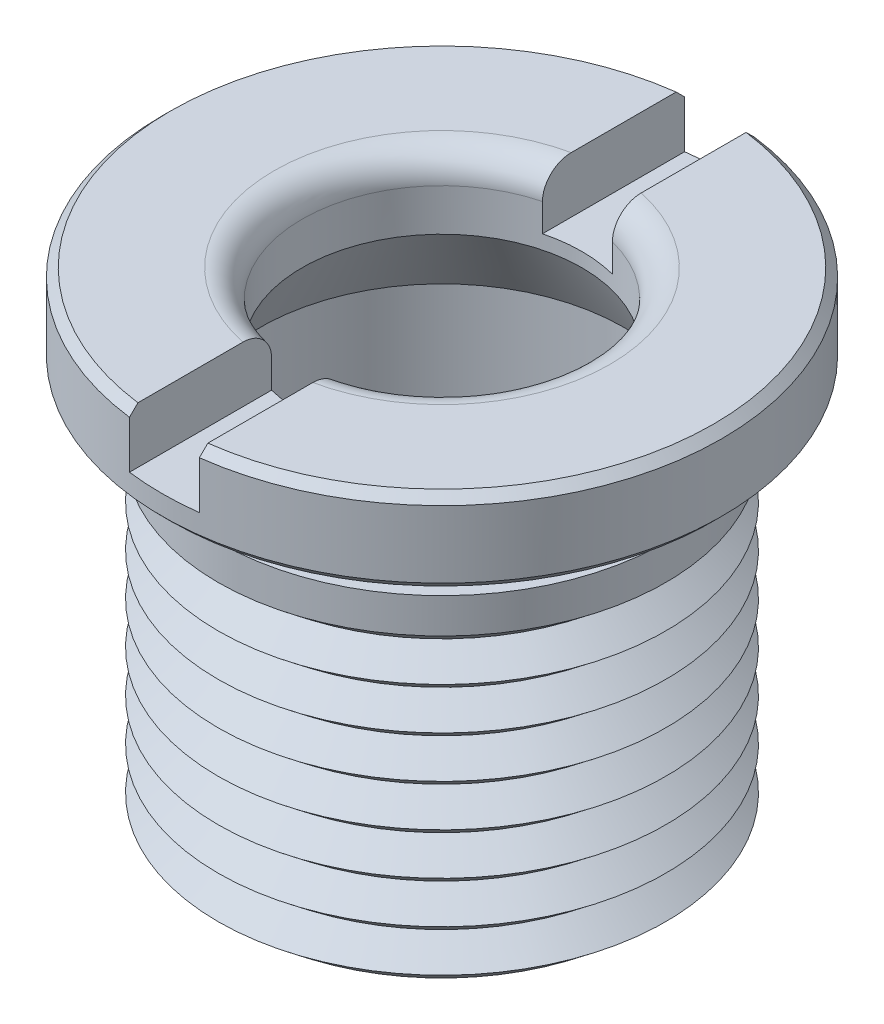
ISO-10303-21;
HEADER;
FILE_DESCRIPTION(('STEP AP214'),'2;1');
FILE_NAME('part.step','',(''),(''),'','','');
FILE_SCHEMA(('AUTOMOTIVE_DESIGN { 1 0 10303 214 1 1 1 1 }'));
ENDSEC;
DATA;
#1=APPLICATION_CONTEXT('core data for automotive mechanical design processes');
#2=APPLICATION_PROTOCOL_DEFINITION('international standard','automotive_design',2000,#1);
#3=PRODUCT_CONTEXT('',#1,'mechanical');
#4=PRODUCT('Part','Part','',(#3));
#5=PRODUCT_RELATED_PRODUCT_CATEGORY('part','',(#4));
#6=PRODUCT_DEFINITION_FORMATION('','',#4);
#7=PRODUCT_DEFINITION_CONTEXT('part definition',#1,'design');
#8=PRODUCT_DEFINITION('design','',#6,#7);
#9=PRODUCT_DEFINITION_SHAPE('','',#8);
#10=(LENGTH_UNIT() NAMED_UNIT(*) SI_UNIT(.MILLI.,.METRE.));
#11=(NAMED_UNIT(*) PLANE_ANGLE_UNIT() SI_UNIT($,.RADIAN.));
#12=(NAMED_UNIT(*) SI_UNIT($,.STERADIAN.) SOLID_ANGLE_UNIT());
#13=UNCERTAINTY_MEASURE_WITH_UNIT(LENGTH_MEASURE(1.E-05),#10,'distance_accuracy_value','');
#14=(GEOMETRIC_REPRESENTATION_CONTEXT(3) GLOBAL_UNCERTAINTY_ASSIGNED_CONTEXT((#13)) GLOBAL_UNIT_ASSIGNED_CONTEXT((#10,
#11,#12)) REPRESENTATION_CONTEXT('',''));
#15=CARTESIAN_POINT('',(0.,0.,0.));
#16=DIRECTION('',(0.,0.,1.));
#17=DIRECTION('',(1.,0.,0.));
#18=AXIS2_PLACEMENT_3D('',#15,#16,#17);
#19=CARTESIAN_POINT('',(0.,16.,0.));
#20=DIRECTION('',(0.,-1.,0.));
#21=DIRECTION('',(0.,0.,-1.));
#22=AXIS2_PLACEMENT_3D('',#19,#20,#21);
#23=TOROIDAL_SURFACE('',#22,6.,0.999999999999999);
#24=CARTESIAN_POINT('',(1.25,16.928266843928,-6.24810363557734));
#25=CARTESIAN_POINT('',(1.25,16.9074070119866,-6.30119341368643));
#26=CARTESIAN_POINT('',(1.25,16.8821125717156,-6.35258083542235));
#27=CARTESIAN_POINT('',(1.25,16.8232719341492,-6.45044671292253));
#28=CARTESIAN_POINT('',(1.25,16.7897174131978,-6.4969201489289));
#29=CARTESIAN_POINT('',(1.25,16.7152311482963,-6.58356028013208));
#30=CARTESIAN_POINT('',(1.25,16.6742971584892,-6.62372504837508));
#31=CARTESIAN_POINT('',(1.25,16.5861950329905,-6.69649041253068));
#32=CARTESIAN_POINT('',(1.25,16.5390284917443,-6.7290929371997));
#33=CARTESIAN_POINT('',(1.25,16.4404486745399,-6.78535697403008));
#34=CARTESIAN_POINT('',(1.25,16.3890987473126,-6.80912946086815));
#35=CARTESIAN_POINT('',(1.25,16.2830993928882,-6.84758420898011));
#36=CARTESIAN_POINT('',(1.25,16.2284501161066,-6.86226688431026));
#37=CARTESIAN_POINT('',(1.25,16.1181854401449,-6.88194693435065));
#38=CARTESIAN_POINT('',(1.25,16.0625925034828,-6.88707031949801));
#39=CARTESIAN_POINT('',(1.25,15.9513410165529,-6.88785766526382));
#40=CARTESIAN_POINT('',(1.25,15.8956824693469,-6.88352205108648));
#41=CARTESIAN_POINT('',(1.25,15.7861785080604,-6.86557328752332));
#42=CARTESIAN_POINT('',(1.25,15.732325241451,-6.85200796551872));
#43=CARTESIAN_POINT('',(1.25,15.6276472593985,-6.81606373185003));
#44=CARTESIAN_POINT('',(1.25,15.5768225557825,-6.79368478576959));
#45=CARTESIAN_POINT('',(1.25,15.4794093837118,-6.7406793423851));
#46=CARTESIAN_POINT('',(1.25,15.4328388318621,-6.71001993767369));
#47=CARTESIAN_POINT('',(1.25,15.3454272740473,-6.64140557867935));
#48=CARTESIAN_POINT('',(1.25,15.304586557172,-6.60345025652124));
#49=CARTESIAN_POINT('',(1.25,15.2292465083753,-6.52084080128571));
#50=CARTESIAN_POINT('',(1.25,15.1948306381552,-6.47611057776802));
#51=CARTESIAN_POINT('',(1.25,15.1338466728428,-6.38158915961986));
#52=CARTESIAN_POINT('',(1.25,15.1072792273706,-6.33179754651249));
#53=CARTESIAN_POINT('',(1.25,15.0622508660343,-6.22764438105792));
#54=CARTESIAN_POINT('',(1.25,15.0439389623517,-6.17321841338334));
#55=CARTESIAN_POINT('',(1.25,15.0165377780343,-6.0620929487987));
#56=CARTESIAN_POINT('',(1.25,15.0074493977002,-6.00539323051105));
#57=CARTESIAN_POINT('',(1.25,14.9986068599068,-5.89027351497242));
#58=CARTESIAN_POINT('',(1.25,14.9990183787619,-5.83184076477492));
#59=CARTESIAN_POINT('',(1.25,15.0095366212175,-5.71585257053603));
#60=CARTESIAN_POINT('',(1.25,15.0196441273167,-5.65829719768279));
#61=CARTESIAN_POINT('',(1.25,15.0494302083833,-5.54507546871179));
#62=CARTESIAN_POINT('',(1.25,15.0692070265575,-5.48943491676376));
#63=CARTESIAN_POINT('',(1.25,15.1178557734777,-5.38227809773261));
#64=CARTESIAN_POINT('',(1.25,15.1467278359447,-5.33076189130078));
#65=CARTESIAN_POINT('',(1.25,15.2126803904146,-5.23358227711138));
#66=CARTESIAN_POINT('',(1.25,15.2497271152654,-5.18789597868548));
#67=CARTESIAN_POINT('',(1.25,15.3311138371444,-5.10355534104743));
#68=CARTESIAN_POINT('',(1.25,15.3754530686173,-5.06490026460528));
#69=CARTESIAN_POINT('',(1.25,15.4691954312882,-4.99662891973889));
#70=CARTESIAN_POINT('',(1.25,15.5184725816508,-4.96683979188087));
#71=CARTESIAN_POINT('',(1.25,15.6214431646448,-4.91624837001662));
#72=CARTESIAN_POINT('',(1.25,15.6751357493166,-4.89544435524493));
#73=CARTESIAN_POINT('',(1.25,15.7837181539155,-4.86404194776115));
#74=CARTESIAN_POINT('',(1.25,15.8385266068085,-4.85316199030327));
#75=CARTESIAN_POINT('',(1.25,15.9491950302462,-4.840963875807));
#76=CARTESIAN_POINT('',(1.25,16.0050548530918,-4.83964438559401));
#77=CARTESIAN_POINT('',(1.25,16.1150760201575,-4.84654318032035));
#78=CARTESIAN_POINT('',(1.25,16.1692491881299,-4.85457489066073));
#79=CARTESIAN_POINT('',(1.25,16.2754838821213,-4.87959080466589));
#80=CARTESIAN_POINT('',(1.25,16.3275454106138,-4.89657499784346));
#81=CARTESIAN_POINT('',(1.25,16.4283071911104,-4.9390019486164));
#82=CARTESIAN_POINT('',(1.25,16.47699508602,-4.96447400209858));
#83=CARTESIAN_POINT('',(1.25,16.5695366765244,-5.02305003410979));
#84=CARTESIAN_POINT('',(1.25,16.613389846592,-5.05615484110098));
#85=CARTESIAN_POINT('',(1.25,16.696137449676,-5.12987039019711));
#86=CARTESIAN_POINT('',(1.25,16.7348904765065,-5.17063979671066));
#87=CARTESIAN_POINT('',(1.25,16.8052308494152,-5.25794755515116));
#88=CARTESIAN_POINT('',(1.25,16.8368174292,-5.30448652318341));
#89=CARTESIAN_POINT('',(1.25,16.8928515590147,-5.40343017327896));
#90=CARTESIAN_POINT('',(1.25,16.9170721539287,-5.45596344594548));
#91=CARTESIAN_POINT('',(1.25,16.9565359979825,-5.56431693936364));
#92=CARTESIAN_POINT('',(1.25,16.9717760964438,-5.62013830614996));
#93=CARTESIAN_POINT('',(1.25,16.99307212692,-5.7345761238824));
#94=CARTESIAN_POINT('',(1.25,16.9989526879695,-5.79322519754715));
#95=CARTESIAN_POINT('',(1.25,17.0007894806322,-5.91063354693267));
#96=CARTESIAN_POINT('',(1.25,16.9967570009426,-5.96939262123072));
#97=CARTESIAN_POINT('',(1.25,16.9819976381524,-6.06510515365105));
#98=CARTESIAN_POINT('',(1.25,16.9740958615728,-6.10251670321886));
#99=CARTESIAN_POINT('',(1.25,16.9542144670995,-6.17624114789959));
#100=CARTESIAN_POINT('',(1.25,16.9422348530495,-6.21255404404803));
#101=CARTESIAN_POINT('',(1.25,16.928266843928,-6.24810363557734));
#102=B_SPLINE_CURVE_WITH_KNOTS('',3,(#24,#25,#26,#27,#28,#29,#30,#31,#32,#33,#34,#35,#36,#37,
#38,#39,#40,#41,#42,#43,#44,#45,#46,#47,#48,#49,#50,#51,#52,#53,#54,#55,#56,#57,#58,#59,#60,#61,
#62,#63,#64,#65,#66,#67,#68,#69,#70,#71,#72,#73,#74,#75,#76,#77,#78,#79,#80,#81,#82,#83,#84,#85,
#86,#87,#88,#89,#90,#91,#92,#93,#94,#95,#96,#97,#98,#99,#100,#101),.UNSPECIFIED.,.T.,.F.,(4,2,2,
2,2,2,2,2,2,2,2,2,2,2,2,2,2,2,2,2,2,2,2,2,2,2,2,2,2,2,2,2,2,2,2,2,2,2,4),(0.,0.170986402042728,
0.342145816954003,0.513357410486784,0.684525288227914,0.853462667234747,1.02239235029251,
1.18907902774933,1.3557582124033,1.52158019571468,1.68740282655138,1.8538944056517,
2.02039438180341,2.18892606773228,2.35747169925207,2.52894843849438,2.70044191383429,
2.87492842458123,3.04942901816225,3.2257406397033,3.40205485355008,3.57765396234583,
3.75323464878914,3.92512597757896,4.09698437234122,4.26379966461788,4.43059169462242,
4.59411211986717,4.75763235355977,4.92172292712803,5.08583131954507,5.25381163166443,
5.42180989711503,5.59455542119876,5.76736151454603,5.94336891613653,6.11917597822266,
6.23367075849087,6.34816543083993),.UNSPECIFIED.);
#103=CARTESIAN_POINT('',(1.25,16.,-4.84122918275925));
#104=VERTEX_POINT('',#103);
#105=CARTESIAN_POINT('',(1.25,17.,-5.86834729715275));
#106=VERTEX_POINT('',#105);
#107=EDGE_CURVE('E288',#104,#106,#102,.T.);
#108=ORIENTED_EDGE('',*,*,#107,.F.);
#109=CARTESIAN_POINT('',(0.,16.,0.));
#110=DIRECTION('',(0.,-1.,0.));
#111=DIRECTION('',(0.,0.,-1.));
#112=AXIS2_PLACEMENT_3D('',#109,#110,#111);
#113=CIRCLE('',#112,5.);
#114=CARTESIAN_POINT('',(1.25,16.,4.84122918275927));
#115=VERTEX_POINT('',#114);
#116=EDGE_CURVE('E182',#104,#115,#113,.T.);
#117=ORIENTED_EDGE('',*,*,#116,.T.);
#118=CARTESIAN_POINT('',(1.25,16.1677028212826,4.85585467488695));
#119=CARTESIAN_POINT('',(1.25,16.1139384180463,4.84641320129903));
#120=CARTESIAN_POINT('',(1.25,16.0593387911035,4.8415088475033));
#121=CARTESIAN_POINT('',(1.25,15.9500541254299,4.84097229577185));
#122=CARTESIAN_POINT('',(1.25,15.8953690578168,4.84535002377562));
#123=CARTESIAN_POINT('',(1.25,15.7875530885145,4.86323023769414));
#124=CARTESIAN_POINT('',(1.25,15.7344210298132,4.87672574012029));
#125=CARTESIAN_POINT('',(1.25,15.6311621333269,4.91237199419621));
#126=CARTESIAN_POINT('',(1.25,15.5810348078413,4.93452133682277));
#127=CARTESIAN_POINT('',(1.25,15.4847130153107,4.98697136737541));
#128=CARTESIAN_POINT('',(1.25,15.4385542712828,5.01733757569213));
#129=CARTESIAN_POINT('',(1.25,15.3518154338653,5.08519832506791));
#130=CARTESIAN_POINT('',(1.25,15.3112361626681,5.12269391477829));
#131=CARTESIAN_POINT('',(1.25,15.2356421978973,5.20481874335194));
#132=CARTESIAN_POINT('',(1.25,15.200806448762,5.24961267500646));
#133=CARTESIAN_POINT('',(1.25,15.1389170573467,5.34428729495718));
#134=CARTESIAN_POINT('',(1.25,15.1118645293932,5.39416871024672));
#135=CARTESIAN_POINT('',(1.25,15.0655891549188,5.49903009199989));
#136=CARTESIAN_POINT('',(1.25,15.0465930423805,5.55411020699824));
#137=CARTESIAN_POINT('',(1.25,15.0179798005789,5.66665647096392));
#138=CARTESIAN_POINT('',(1.25,15.0083634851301,5.72412282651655));
#139=CARTESIAN_POINT('',(1.25,14.9987150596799,5.84062378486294));
#140=CARTESIAN_POINT('',(1.25,14.9988112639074,5.89966907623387));
#141=CARTESIAN_POINT('',(1.25,15.008946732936,6.01690280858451));
#142=CARTESIAN_POINT('',(1.25,15.0189860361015,6.07509124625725));
#143=CARTESIAN_POINT('',(1.25,15.0487380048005,6.18874002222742));
#144=CARTESIAN_POINT('',(1.25,15.0684188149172,6.24420868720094));
#145=CARTESIAN_POINT('',(1.25,15.1169510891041,6.35098032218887));
#146=CARTESIAN_POINT('',(1.25,15.1458019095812,6.40228358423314));
#147=CARTESIAN_POINT('',(1.25,15.2114140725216,6.49844291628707));
#148=CARTESIAN_POINT('',(1.25,15.2480519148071,6.54338322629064));
#149=CARTESIAN_POINT('',(1.25,15.3284813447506,6.62632933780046));
#150=CARTESIAN_POINT('',(1.25,15.372272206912,6.66433584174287));
#151=CARTESIAN_POINT('',(1.25,15.4648937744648,6.7315926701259));
#152=CARTESIAN_POINT('',(1.25,15.5136165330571,6.76099166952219));
#153=CARTESIAN_POINT('',(1.25,15.6153644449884,6.81104443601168));
#154=CARTESIAN_POINT('',(1.25,15.6683892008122,6.83169901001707));
#155=CARTESIAN_POINT('',(1.25,15.7763596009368,6.86336543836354));
#156=CARTESIAN_POINT('',(1.25,15.8312633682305,6.87452018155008));
#157=CARTESIAN_POINT('',(1.25,15.942166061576,6.88737161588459));
#158=CARTESIAN_POINT('',(1.25,15.9981649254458,6.88906884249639));
#159=CARTESIAN_POINT('',(1.25,16.1091948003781,6.88297779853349));
#160=CARTESIAN_POINT('',(1.25,16.1642299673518,6.8752649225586));
#161=CARTESIAN_POINT('',(1.25,16.2722252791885,6.85071795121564));
#162=CARTESIAN_POINT('',(1.25,16.3251854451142,6.83388394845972));
#163=CARTESIAN_POINT('',(1.25,16.4276050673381,6.79158290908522));
#164=CARTESIAN_POINT('',(1.25,16.4770605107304,6.76610616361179));
#165=CARTESIAN_POINT('',(1.25,16.5710471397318,6.70728826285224));
#166=CARTESIAN_POINT('',(1.25,16.6155781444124,6.67394681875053));
#167=CARTESIAN_POINT('',(1.25,16.6989360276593,6.60001434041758));
#168=CARTESIAN_POINT('',(1.25,16.7377025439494,6.55935527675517));
#169=CARTESIAN_POINT('',(1.25,16.8079892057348,6.47219635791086));
#170=CARTESIAN_POINT('',(1.25,16.8395088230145,6.42569607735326));
#171=CARTESIAN_POINT('',(1.25,16.8949595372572,6.32737619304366));
#172=CARTESIAN_POINT('',(1.25,16.9187595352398,6.27548266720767));
#173=CARTESIAN_POINT('',(1.25,16.9574847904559,6.16848467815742));
#174=CARTESIAN_POINT('',(1.25,16.9724091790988,6.11337990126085));
#175=CARTESIAN_POINT('',(1.25,16.9932342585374,6.00045679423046));
#176=CARTESIAN_POINT('',(1.25,16.9989665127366,5.94260738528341));
#177=CARTESIAN_POINT('',(1.25,17.0007781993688,5.82675656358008));
#178=CARTESIAN_POINT('',(1.25,16.9968567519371,5.76875513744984));
#179=CARTESIAN_POINT('',(1.25,16.9793730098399,5.65341924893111));
#180=CARTESIAN_POINT('',(1.25,16.965681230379,5.59610437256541));
#181=CARTESIAN_POINT('',(1.25,16.9288850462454,5.48457842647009));
#182=CARTESIAN_POINT('',(1.25,16.9057805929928,5.43036737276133));
#183=CARTESIAN_POINT('',(1.25,16.850729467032,5.32655740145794));
#184=CARTESIAN_POINT('',(1.25,16.8187732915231,5.276963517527));
#185=CARTESIAN_POINT('',(1.25,16.7468534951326,5.18393984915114));
#186=CARTESIAN_POINT('',(1.25,16.7068883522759,5.14051123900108));
#187=CARTESIAN_POINT('',(1.25,16.6207174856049,5.06183631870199));
#188=CARTESIAN_POINT('',(1.25,16.5746175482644,5.02647411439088));
#189=CARTESIAN_POINT('',(1.25,16.4770285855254,4.96429811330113));
#190=CARTESIAN_POINT('',(1.25,16.4255474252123,4.93747206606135));
#191=CARTESIAN_POINT('',(1.25,16.3392862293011,4.90177880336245));
#192=CARTESIAN_POINT('',(1.25,16.3056926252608,4.88997204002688));
#193=CARTESIAN_POINT('',(1.25,16.2374184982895,4.87008624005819));
#194=CARTESIAN_POINT('',(1.25,16.202737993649,4.86200714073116));
#195=CARTESIAN_POINT('',(1.25,16.1677028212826,4.85585467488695));
#196=B_SPLINE_CURVE_WITH_KNOTS('',3,(#118,#119,#120,#121,#122,#123,#124,#125,#126,#127,#128,
#129,#130,#131,#132,#133,#134,#135,#136,#137,#138,#139,#140,#141,#142,#143,#144,#145,#146,#147,
#148,#149,#150,#151,#152,#153,#154,#155,#156,#157,#158,#159,#160,#161,#162,#163,#164,#165,#166,
#167,#168,#169,#170,#171,#172,#173,#174,#175,#176,#177,#178,#179,#180,#181,#182,#183,#184,#185,
#186,#187,#188,#189,#190,#191,#192,#193,#194,#195),.UNSPECIFIED.,.T.,.F.,(4,2,2,2,2,2,2,2,2,2,2,
2,2,2,2,2,2,2,2,2,2,2,2,2,2,2,2,2,2,2,2,2,2,2,2,2,2,2,4),(0.,0.163631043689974,0.32743715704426,
0.491117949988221,0.654772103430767,0.819771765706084,0.984795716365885,1.15425654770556,
1.32374162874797,1.49772263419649,1.67171873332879,1.84801383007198,2.02430960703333,
2.20002679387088,2.37573165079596,2.54883397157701,2.72191874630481,2.89180867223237,
3.06168291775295,3.22895450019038,3.39621661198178,3.56214736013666,3.72807642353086,
3.89419250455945,4.06031468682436,4.22806954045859,4.39583661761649,4.56631943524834,
4.73681893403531,4.91040836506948,5.08401361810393,5.25996341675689,5.43591412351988,
5.61205445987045,5.78822830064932,5.96168426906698,6.1348901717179,6.24152091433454,
6.34814986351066),.UNSPECIFIED.);
#197=CARTESIAN_POINT('',(1.25,17.,5.86834729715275));
#198=VERTEX_POINT('',#197);
#199=EDGE_CURVE('E275',#198,#115,#196,.T.);
#200=ORIENTED_EDGE('',*,*,#199,.F.);
#201=CARTESIAN_POINT('',(0.,17.,0.));
#202=DIRECTION('',(0.,-1.,0.));
#203=DIRECTION('',(0.,0.,-1.));
#204=AXIS2_PLACEMENT_3D('',#201,#202,#203);
#205=CIRCLE('',#204,6.);
#206=EDGE_CURVE('E177',#106,#198,#205,.T.);
#207=ORIENTED_EDGE('',*,*,#206,.F.);
#208=EDGE_LOOP('',(#108,#117,#200,#207));
#209=FACE_BOUND('',#208,.T.);
#210=ADVANCED_FACE('F38',(#209),#23,.T.);
#211=CARTESIAN_POINT('',(9.7,17.,0.));
#212=DIRECTION('',(0.,1.,0.));
#213=DIRECTION('',(0.,0.,1.));
#214=AXIS2_PLACEMENT_3D('',#211,#212,#213);
#215=PLANE('',#214);
#216=DIRECTION('',(0.,0.,-1.));
#217=VECTOR('',#216,1.);
#218=CARTESIAN_POINT('',(1.25,17.,10.));
#219=LINE('',#218,#217);
#220=CARTESIAN_POINT('',(1.25,17.,9.61912158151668));
#221=VERTEX_POINT('',#220);
#222=EDGE_CURVE('E366',#221,#198,#219,.T.);
#223=ORIENTED_EDGE('',*,*,#222,.F.);
#224=CARTESIAN_POINT('',(0.,17.,0.));
#225=DIRECTION('',(0.,-1.,0.));
#226=DIRECTION('',(0.,0.,-1.));
#227=AXIS2_PLACEMENT_3D('',#224,#225,#226);
#228=CIRCLE('',#227,9.7);
#229=CARTESIAN_POINT('',(1.25,17.,-9.61912158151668));
#230=VERTEX_POINT('',#229);
#231=EDGE_CURVE('E166',#230,#221,#228,.T.);
#232=ORIENTED_EDGE('',*,*,#231,.F.);
#233=EDGE_CURVE('E364',#106,#230,#219,.T.);
#234=ORIENTED_EDGE('',*,*,#233,.F.);
#235=ORIENTED_EDGE('',*,*,#206,.T.);
#236=EDGE_LOOP('',(#223,#232,#234,#235));
#237=FACE_BOUND('',#236,.T.);
#238=ADVANCED_FACE('F340',(#237),#215,.T.);
#239=CARTESIAN_POINT('',(0.,16.7,0.));
#240=DIRECTION('',(0.,-1.,0.));
#241=DIRECTION('',(0.,0.,-1.));
#242=AXIS2_PLACEMENT_3D('',#239,#240,#241);
#243=CONICAL_SURFACE('',#242,10.,0.785398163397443);
#244=CARTESIAN_POINT('',(1.25,4.69845007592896,21.9660123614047));
#245=CARTESIAN_POINT('',(1.25,5.44447393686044,21.2187724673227));
#246=CARTESIAN_POINT('',(1.25,6.19044487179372,20.4714797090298));
#247=CARTESIAN_POINT('',(1.25,7.68222304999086,18.9767139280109));
#248=CARTESIAN_POINT('',(1.25,8.42803029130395,18.2292409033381));
#249=CARTESIAN_POINT('',(1.25,9.91959558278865,16.7338672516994));
#250=CARTESIAN_POINT('',(1.25,10.6653535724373,15.9859665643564));
#251=CARTESIAN_POINT('',(1.25,12.1564989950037,14.4898123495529));
#252=CARTESIAN_POINT('',(1.25,12.9018864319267,13.7415588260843));
#253=CARTESIAN_POINT('',(1.25,14.4174581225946,12.2189997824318));
#254=CARTESIAN_POINT('',(1.25,15.1876226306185,11.4446745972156));
#255=CARTESIAN_POINT('',(1.25,16.3420491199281,10.2823454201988));
#256=CARTESIAN_POINT('',(1.25,16.726727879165,9.89475542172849));
#257=CARTESIAN_POINT('',(1.25,17.4956859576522,9.11918186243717));
#258=CARTESIAN_POINT('',(1.25,17.8799652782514,8.73119830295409));
#259=CARTESIAN_POINT('',(1.25,18.647876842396,7.95471526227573));
#260=CARTESIAN_POINT('',(1.25,19.0315091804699,7.56621587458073));
#261=CARTESIAN_POINT('',(1.25,19.7978772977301,6.7883227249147));
#262=CARTESIAN_POINT('',(1.25,20.1806130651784,6.39892895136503));
#263=CARTESIAN_POINT('',(1.25,20.7535495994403,5.81371808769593));
#264=CARTESIAN_POINT('',(1.25,20.9443282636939,5.61846692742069));
#265=CARTESIAN_POINT('',(1.25,21.3253569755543,5.22744966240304));
#266=CARTESIAN_POINT('',(1.25,21.515607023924,5.03168355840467));
#267=CARTESIAN_POINT('',(1.25,21.895366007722,4.63944149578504));
#268=CARTESIAN_POINT('',(1.25,22.0848749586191,4.44296555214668));
#269=CARTESIAN_POINT('',(1.25,22.4628223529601,4.04898727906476));
#270=CARTESIAN_POINT('',(1.25,22.6512608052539,3.85148495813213));
#271=CARTESIAN_POINT('',(1.25,22.8893433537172,3.59984661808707));
#272=CARTESIAN_POINT('',(1.25,22.9397586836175,3.54644022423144));
#273=CARTESIAN_POINT('',(1.25,23.0404499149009,3.43949596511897));
#274=CARTESIAN_POINT('',(1.25,23.0907258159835,3.3859580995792));
#275=CARTESIAN_POINT('',(1.25,23.2413179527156,3.2251208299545));
#276=CARTESIAN_POINT('',(1.25,23.3413972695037,3.11759918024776));
#277=CARTESIAN_POINT('',(1.25,23.5403785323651,2.90213891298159));
#278=CARTESIAN_POINT('',(1.25,23.6392833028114,2.79420290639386));
#279=CARTESIAN_POINT('',(1.25,23.8359423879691,2.57729135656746));
#280=CARTESIAN_POINT('',(1.25,23.9336967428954,2.46831584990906));
#281=CARTESIAN_POINT('',(1.25,24.0955311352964,2.28515529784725));
#282=CARTESIAN_POINT('',(1.25,24.1600655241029,2.21137215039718));
#283=CARTESIAN_POINT('',(1.25,24.2881661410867,2.06297103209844));
#284=CARTESIAN_POINT('',(1.25,24.3517323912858,1.98835308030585));
#285=CARTESIAN_POINT('',(1.25,24.4779659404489,1.83756608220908));
#286=CARTESIAN_POINT('',(1.25,24.540625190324,1.76139027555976));
#287=CARTESIAN_POINT('',(1.25,24.6641352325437,1.60759104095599));
#288=CARTESIAN_POINT('',(1.25,24.7249862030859,1.529967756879));
#289=CARTESIAN_POINT('',(1.25,24.844845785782,1.3717881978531));
#290=CARTESIAN_POINT('',(1.25,24.9038224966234,1.29120758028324));
#291=CARTESIAN_POINT('',(1.25,25.0178987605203,1.1271437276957));
#292=CARTESIAN_POINT('',(1.25,25.072993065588,1.0436567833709));
#293=CARTESIAN_POINT('',(1.25,25.1764879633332,0.873572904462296));
#294=CARTESIAN_POINT('',(1.25,25.224942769,0.78700946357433));
#295=CARTESIAN_POINT('',(1.25,25.3117119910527,0.608965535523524));
#296=CARTESIAN_POINT('',(1.25,25.3500572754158,0.517501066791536));
#297=CARTESIAN_POINT('',(1.25,25.3940193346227,0.380438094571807));
#298=CARTESIAN_POINT('',(1.25,25.4060979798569,0.336924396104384));
#299=CARTESIAN_POINT('',(1.25,25.4261695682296,0.248950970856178));
#300=CARTESIAN_POINT('',(1.25,25.4341631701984,0.204491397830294));
#301=CARTESIAN_POINT('',(1.25,25.4454755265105,0.115229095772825));
#302=CARTESIAN_POINT('',(1.25,25.4488208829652,0.0704298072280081));
#303=CARTESIAN_POINT('',(1.25,25.4506557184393,-0.0192705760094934));
#304=CARTESIAN_POINT('',(1.25,25.4491452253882,-0.0641716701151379));
#305=CARTESIAN_POINT('',(1.25,25.4414070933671,-0.153377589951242));
#306=CARTESIAN_POINT('',(1.25,25.4351980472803,-0.197684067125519));
#307=CARTESIAN_POINT('',(1.25,25.4185374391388,-0.285495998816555));
#308=CARTESIAN_POINT('',(1.25,25.4080839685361,-0.329001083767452));
#309=CARTESIAN_POINT('',(1.25,25.3834783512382,-0.415275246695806));
#310=CARTESIAN_POINT('',(1.25,25.3693000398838,-0.458036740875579));
#311=CARTESIAN_POINT('',(1.25,25.3379468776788,-0.542422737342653));
#312=CARTESIAN_POINT('',(1.25,25.3207724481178,-0.584047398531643));
#313=CARTESIAN_POINT('',(1.25,25.2708292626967,-0.695721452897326));
#314=CARTESIAN_POINT('',(1.25,25.235718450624,-0.764718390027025));
#315=CARTESIAN_POINT('',(1.25,25.1606951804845,-0.900073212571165));
#316=CARTESIAN_POINT('',(1.25,25.1207775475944,-0.966428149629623));
#317=CARTESIAN_POINT('',(1.25,25.0374946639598,-1.09725764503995));
#318=CARTESIAN_POINT('',(1.25,24.9941174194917,-1.16172449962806));
#319=CARTESIAN_POINT('',(1.25,24.9050362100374,-1.28897444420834));
#320=CARTESIAN_POINT('',(1.25,24.8593332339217,-1.35175823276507));
#321=CARTESIAN_POINT('',(1.25,24.7657836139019,-1.47662344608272));
#322=CARTESIAN_POINT('',(1.25,24.7179208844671,-1.53869276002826));
#323=CARTESIAN_POINT('',(1.25,24.6208943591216,-1.66181057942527));
#324=CARTESIAN_POINT('',(1.25,24.5717304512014,-1.72285899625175));
#325=CARTESIAN_POINT('',(1.25,24.4725275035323,-1.84400079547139));
#326=CARTESIAN_POINT('',(1.25,24.4224907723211,-1.90409607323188));
#327=CARTESIAN_POINT('',(1.25,24.3216477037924,-2.02363183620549));
#328=CARTESIAN_POINT('',(1.25,24.2708413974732,-2.08307234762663));
#329=CARTESIAN_POINT('',(1.25,24.1196610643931,-2.25811443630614));
#330=CARTESIAN_POINT('',(1.25,24.0184251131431,-2.37297108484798));
#331=CARTESIAN_POINT('',(1.25,23.8144037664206,-2.60130215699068));
#332=CARTESIAN_POINT('',(1.25,23.7116182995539,-2.71477651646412));
#333=CARTESIAN_POINT('',(1.25,23.5049439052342,-2.94074317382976));
#334=CARTESIAN_POINT('',(1.25,23.4010548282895,-3.05323533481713));
#335=CARTESIAN_POINT('',(1.25,23.1924808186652,-3.27748002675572));
#336=CARTESIAN_POINT('',(1.25,23.0877958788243,-3.38923255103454));
#337=CARTESIAN_POINT('',(1.25,22.7726091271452,-3.72392146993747));
#338=CARTESIAN_POINT('',(1.25,22.5612210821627,-3.94602271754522));
#339=CARTESIAN_POINT('',(1.25,22.1370494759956,-4.38884952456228));
#340=CARTESIAN_POINT('',(1.25,21.9242660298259,-4.60957519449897));
#341=CARTESIAN_POINT('',(1.25,21.4999185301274,-5.04790346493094));
#342=CARTESIAN_POINT('',(1.25,21.288363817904,-5.26551511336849));
#343=CARTESIAN_POINT('',(1.25,20.8646208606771,-5.70012912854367));
#344=CARTESIAN_POINT('',(1.25,20.6524326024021,-5.91713148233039));
#345=CARTESIAN_POINT('',(1.25,20.2277074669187,-6.3505860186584));
#346=CARTESIAN_POINT('',(1.25,20.0151708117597,-6.56703841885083));
#347=CARTESIAN_POINT('',(1.25,19.589760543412,-6.99960887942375));
#348=CARTESIAN_POINT('',(1.25,19.3768869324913,-7.21572694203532));
#349=CARTESIAN_POINT('',(1.25,18.5696719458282,-8.03429453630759));
#350=CARTESIAN_POINT('',(1.25,17.9744808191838,-8.63590591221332));
#351=CARTESIAN_POINT('',(1.25,16.7830911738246,-9.83813322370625));
#352=CARTESIAN_POINT('',(1.25,16.1868926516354,-10.4387491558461));
#353=CARTESIAN_POINT('',(1.25,14.9937613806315,-11.6395056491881));
#354=CARTESIAN_POINT('',(1.25,14.3968285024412,-12.2396460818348));
#355=CARTESIAN_POINT('',(1.25,13.2025770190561,-13.4395415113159));
#356=CARTESIAN_POINT('',(1.25,12.6052584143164,-14.0392965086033));
#357=CARTESIAN_POINT('',(1.25,11.3989965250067,-15.2499477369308));
#358=CARTESIAN_POINT('',(1.25,10.7900481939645,-15.8608389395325));
#359=CARTESIAN_POINT('',(1.25,9.5719590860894,-17.0824299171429));
#360=CARTESIAN_POINT('',(1.25,8.96281830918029,-17.6931296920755));
#361=CARTESIAN_POINT('',(1.25,7.74453275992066,-18.9142532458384));
#362=CARTESIAN_POINT('',(1.25,7.1353880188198,-19.5246770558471));
#363=CARTESIAN_POINT('',(1.25,5.91699136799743,-20.7454171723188));
#364=CARTESIAN_POINT('',(1.25,5.30773945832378,-21.3557334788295));
#365=CARTESIAN_POINT('',(1.25,4.69845007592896,-21.9660123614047));
#366=B_SPLINE_CURVE_WITH_KNOTS('',3,(#244,#245,#246,#247,#248,#249,#250,#251,#252,#253,#254,
#255,#256,#257,#258,#259,#260,#261,#262,#263,#264,#265,#266,#267,#268,#269,#270,#271,#272,#273,
#274,#275,#276,#277,#278,#279,#280,#281,#282,#283,#284,#285,#286,#287,#288,#289,#290,#291,#292,
#293,#294,#295,#296,#297,#298,#299,#300,#301,#302,#303,#304,#305,#306,#307,#308,#309,#310,#311,
#312,#313,#314,#315,#316,#317,#318,#319,#320,#321,#322,#323,#324,#325,#326,#327,#328,#329,#330,
#331,#332,#333,#334,#335,#336,#337,#338,#339,#340,#341,#342,#343,#344,#345,#346,#347,#348,#349,
#350,#351,#352,#353,#354,#355,#356,#357,#358,#359,#360,#361,#362,#363,#364,#365),.UNSPECIFIED.,
.F.,.F.,(4,2,2,2,2,2,2,2,2,2,2,2,2,2,2,2,2,2,2,2,2,2,2,2,2,2,2,2,2,2,2,2,2,2,2,2,2,2,2,2,2,2,2,
2,2,2,2,2,2,2,2,2,2,2,2,2,2,2,2,2,4),(0.,3.16769185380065,6.33541960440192,9.50395130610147,
12.6724479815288,15.9488165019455,17.5870573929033,19.2252927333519,20.8632633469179,
22.5012552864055,23.3202025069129,24.1391485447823,24.9580773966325,25.7769994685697,
25.9973297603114,26.2176605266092,26.6583279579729,27.0975162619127,27.5366891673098,
27.8307540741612,28.1248122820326,28.4206992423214,28.7165569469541,29.0160567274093,
29.3159538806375,29.613234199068,29.9095960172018,30.0449125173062,30.1802071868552,
30.3147243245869,30.4492406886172,30.5832275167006,30.7172746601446,30.8522898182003,
30.9872860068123,31.219221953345,31.4514098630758,31.6844409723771,31.9173738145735,
32.1524913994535,32.3876292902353,32.6222187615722,32.8567988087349,33.3160856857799,
33.7753937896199,34.2347649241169,34.6941401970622,35.6139780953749,36.5337411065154,
37.4442291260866,38.3547363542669,39.2647969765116,40.1748514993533,42.7136865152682,
45.2525303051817,47.7919150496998,50.3312968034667,52.9189704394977,55.5066451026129,
58.0937420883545,60.6808379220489),.UNSPECIFIED.);
#367=CARTESIAN_POINT('',(1.25,16.7,9.92156741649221));
#368=VERTEX_POINT('',#367);
#369=EDGE_CURVE('E281',#368,#221,#366,.T.);
#370=ORIENTED_EDGE('',*,*,#369,.F.);
#371=CARTESIAN_POINT('',(0.,16.7,0.));
#372=DIRECTION('',(0.,-1.,0.));
#373=DIRECTION('',(0.,0.,-1.));
#374=AXIS2_PLACEMENT_3D('',#371,#372,#373);
#375=CIRCLE('',#374,10.);
#376=CARTESIAN_POINT('',(1.25,16.7,-9.92156741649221));
#377=VERTEX_POINT('',#376);
#378=EDGE_CURVE('E154',#377,#368,#375,.T.);
#379=ORIENTED_EDGE('',*,*,#378,.F.);
#380=EDGE_CURVE('E282',#230,#377,#366,.T.);
#381=ORIENTED_EDGE('',*,*,#380,.F.);
#382=ORIENTED_EDGE('',*,*,#231,.T.);
#383=EDGE_LOOP('',(#370,#379,#381,#382));
#384=FACE_BOUND('',#383,.T.);
#385=ADVANCED_FACE('F338',(#384),#243,.T.);
#386=CARTESIAN_POINT('',(0.,0.,0.));
#387=DIRECTION('',(0.,-1.,0.));
#388=DIRECTION('',(0.,0.,-1.));
#389=AXIS2_PLACEMENT_3D('',#386,#387,#388);
#390=CYLINDRICAL_SURFACE('',#389,6.5);
#391=CARTESIAN_POINT('',(0.,0.,0.));
#392=DIRECTION('',(0.,-1.,0.));
#393=DIRECTION('',(0.,0.,-1.));
#394=AXIS2_PLACEMENT_3D('',#391,#392,#393);
#395=CIRCLE('',#394,6.5);
#396=CARTESIAN_POINT('',(0.,0.,-6.5));
#397=VERTEX_POINT('',#396);
#398=EDGE_CURVE('E296',#397,#397,#395,.T.);
#399=ORIENTED_EDGE('',*,*,#398,.T.);
#400=EDGE_LOOP('',(#399));
#401=FACE_BOUND('',#400,.T.);
#402=CARTESIAN_POINT('',(0.,11.9,0.));
#403=DIRECTION('',(0.,-1.,0.));
#404=DIRECTION('',(0.,0.,-1.));
#405=AXIS2_PLACEMENT_3D('',#402,#403,#404);
#406=CIRCLE('',#405,6.5);
#407=CARTESIAN_POINT('',(0.,11.9,-6.5));
#408=VERTEX_POINT('',#407);
#409=EDGE_CURVE('E190',#408,#408,#406,.T.);
#410=ORIENTED_EDGE('',*,*,#409,.F.);
#411=EDGE_LOOP('',(#410));
#412=FACE_BOUND('',#411,.T.);
#413=ADVANCED_FACE('F40',(#401,#412),#390,.F.);
#414=CARTESIAN_POINT('',(0.,14.4980762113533,0.));
#415=DIRECTION('',(0.,-1.,0.));
#416=DIRECTION('',(0.,0.,-1.));
#417=AXIS2_PLACEMENT_3D('',#414,#415,#416);
#418=CONICAL_SURFACE('',#417,5.,0.5235987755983);
#419=ORIENTED_EDGE('',*,*,#409,.T.);
#420=EDGE_LOOP('',(#419));
#421=FACE_BOUND('',#420,.T.);
#422=CARTESIAN_POINT('',(0.,14.4980762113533,0.));
#423=DIRECTION('',(0.,-1.,0.));
#424=DIRECTION('',(0.,0.,-1.));
#425=AXIS2_PLACEMENT_3D('',#422,#423,#424);
#426=CIRCLE('',#425,5.);
#427=CARTESIAN_POINT('',(0.,14.4980762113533,-5.));
#428=VERTEX_POINT('',#427);
#429=EDGE_CURVE('E186',#428,#428,#426,.T.);
#430=ORIENTED_EDGE('',*,*,#429,.F.);
#431=EDGE_LOOP('',(#430));
#432=FACE_BOUND('',#431,.T.);
#433=ADVANCED_FACE('F738',(#421,#432),#418,.F.);
#434=CARTESIAN_POINT('',(0.,0.,0.));
#435=DIRECTION('',(0.,-1.,0.));
#436=DIRECTION('',(0.,0.,-1.));
#437=AXIS2_PLACEMENT_3D('',#434,#435,#436);
#438=CYLINDRICAL_SURFACE('',#437,5.);
#439=DIRECTION('',(0.,-1.,0.));
#440=VECTOR('',#439,1.);
#441=CARTESIAN_POINT('',(1.25,0.,4.84122918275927));
#442=LINE('',#441,#440);
#443=CARTESIAN_POINT('',(1.25,15.,4.84122918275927));
#444=VERTEX_POINT('',#443);
#445=EDGE_CURVE('E146',#115,#444,#442,.T.);
#446=ORIENTED_EDGE('',*,*,#445,.F.);
#447=ORIENTED_EDGE('',*,*,#116,.F.);
#448=DIRECTION('',(0.,-1.,0.));
#449=VECTOR('',#448,1.);
#450=CARTESIAN_POINT('',(1.25,0.,-4.84122918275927));
#451=LINE('',#450,#449);
#452=CARTESIAN_POINT('',(1.25,15.,-4.84122918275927));
#453=VERTEX_POINT('',#452);
#454=EDGE_CURVE('E61',#453,#104,#451,.F.);
#455=ORIENTED_EDGE('',*,*,#454,.F.);
#456=CARTESIAN_POINT('',(0.,15.,0.));
#457=DIRECTION('',(0.,-1.,0.));
#458=DIRECTION('',(0.,0.,-1.));
#459=AXIS2_PLACEMENT_3D('',#456,#457,#458);
#460=CIRCLE('',#459,5.);
#461=CARTESIAN_POINT('',(-1.25,15.,-4.84122918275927));
#462=VERTEX_POINT('',#461);
#463=EDGE_CURVE('E232',#462,#453,#460,.T.);
#464=ORIENTED_EDGE('',*,*,#463,.F.);
#465=DIRECTION('',(0.,-1.,0.));
#466=VECTOR('',#465,1.);
#467=CARTESIAN_POINT('',(-1.25,0.,-4.84122918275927));
#468=LINE('',#467,#466);
#469=CARTESIAN_POINT('',(-1.25,16.0000000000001,-4.84122918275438));
#470=VERTEX_POINT('',#469);
#471=EDGE_CURVE('E261',#470,#462,#468,.T.);
#472=ORIENTED_EDGE('',*,*,#471,.F.);
#473=CARTESIAN_POINT('',(-1.25,16.,4.84122918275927));
#474=VERTEX_POINT('',#473);
#475=EDGE_CURVE('E181',#474,#470,#113,.T.);
#476=ORIENTED_EDGE('',*,*,#475,.F.);
#477=DIRECTION('',(0.,-1.,0.));
#478=VECTOR('',#477,1.);
#479=CARTESIAN_POINT('',(-1.25,0.,4.84122918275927));
#480=LINE('',#479,#478);
#481=CARTESIAN_POINT('',(-1.25,15.,4.84122918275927));
#482=VERTEX_POINT('',#481);
#483=EDGE_CURVE('E221',#482,#474,#480,.F.);
#484=ORIENTED_EDGE('',*,*,#483,.F.);
#485=EDGE_CURVE('E224',#444,#482,#460,.T.);
#486=ORIENTED_EDGE('',*,*,#485,.F.);
#487=EDGE_LOOP('',(#446,#447,#455,#464,#472,#476,#484,#486));
#488=FACE_BOUND('',#487,.T.);
#489=ORIENTED_EDGE('',*,*,#429,.T.);
#490=EDGE_LOOP('',(#489));
#491=FACE_BOUND('',#490,.T.);
#492=ADVANCED_FACE('F268',(#488,#491),#438,.F.);
#493=CARTESIAN_POINT('',(-1.25,16.928266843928,-6.24810363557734));
#494=CARTESIAN_POINT('',(-1.25,16.9496319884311,-6.19371403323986));
#495=CARTESIAN_POINT('',(-1.25,16.9663736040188,-6.13745753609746));
#496=CARTESIAN_POINT('',(-1.25,16.9901686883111,-6.02287814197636));
#497=CARTESIAN_POINT('',(-1.25,16.9972083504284,-5.96455242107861));
#498=CARTESIAN_POINT('',(-1.25,17.0014292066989,-5.84759762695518));
#499=CARTESIAN_POINT('',(-1.25,16.9986198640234,-5.78896889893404));
#500=CARTESIAN_POINT('',(-1.25,16.9832696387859,-5.67301793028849));
#501=CARTESIAN_POINT('',(-1.25,16.9707313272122,-5.61569534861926));
#502=CARTESIAN_POINT('',(-1.25,16.9361519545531,-5.50357034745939));
#503=CARTESIAN_POINT('',(-1.25,16.9140482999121,-5.4487872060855));
#504=CARTESIAN_POINT('',(-1.25,16.8609027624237,-5.34373411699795));
#505=CARTESIAN_POINT('',(-1.25,16.8298604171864,-5.29346440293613));
#506=CARTESIAN_POINT('',(-1.25,16.7598696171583,-5.1992480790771));
#507=CARTESIAN_POINT('',(-1.25,16.7209715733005,-5.15526406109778));
#508=CARTESIAN_POINT('',(-1.25,16.6361895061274,-5.07463650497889));
#509=CARTESIAN_POINT('',(-1.25,16.5903063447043,-5.03799206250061));
#510=CARTESIAN_POINT('',(-1.25,16.4939546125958,-4.97401274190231));
#511=CARTESIAN_POINT('',(-1.25,16.4436143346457,-4.94648477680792));
#512=CARTESIAN_POINT('',(-1.25,16.3389261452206,-4.90056506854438));
#513=CARTESIAN_POINT('',(-1.25,16.2845790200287,-4.88217153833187));
#514=CARTESIAN_POINT('',(-1.25,16.1751272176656,-4.85558180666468));
#515=CARTESIAN_POINT('',(-1.25,16.1200909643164,-4.8471036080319));
#516=CARTESIAN_POINT('',(-1.25,16.0093818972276,-4.83968748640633));
#517=CARTESIAN_POINT('',(-1.25,15.9537091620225,-4.84074839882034));
#518=CARTESIAN_POINT('',(-1.25,15.8443188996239,-4.85226899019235));
#519=CARTESIAN_POINT('',(-1.25,15.7905842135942,-4.86256681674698));
#520=CARTESIAN_POINT('',(-1.25,15.6855893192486,-4.89198173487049));
#521=CARTESIAN_POINT('',(-1.25,15.6343291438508,-4.911098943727));
#522=CARTESIAN_POINT('',(-1.25,15.535347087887,-4.95767398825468));
#523=CARTESIAN_POINT('',(-1.25,15.4876504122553,-4.98518530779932));
#524=CARTESIAN_POINT('',(-1.25,15.3974024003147,-5.04763825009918));
#525=CARTESIAN_POINT('',(-1.25,15.3548516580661,-5.08258072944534));
#526=CARTESIAN_POINT('',(-1.25,15.2749514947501,-5.15982732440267));
#527=CARTESIAN_POINT('',(-1.25,15.2377596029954,-5.20229433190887));
#528=CARTESIAN_POINT('',(-1.25,15.1708001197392,-5.29272462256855));
#529=CARTESIAN_POINT('',(-1.25,15.1410336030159,-5.34068869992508));
#530=CARTESIAN_POINT('',(-1.25,15.0889254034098,-5.44218794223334));
#531=CARTESIAN_POINT('',(-1.25,15.0668128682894,-5.49584082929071));
#532=CARTESIAN_POINT('',(-1.25,15.0317450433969,-5.60606146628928));
#533=CARTESIAN_POINT('',(-1.25,15.0187906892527,-5.66262951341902));
#534=CARTESIAN_POINT('',(-1.25,15.0022511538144,-5.77805414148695));
#535=CARTESIAN_POINT('',(-1.25,14.9988202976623,-5.83693291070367));
#536=CARTESIAN_POINT('',(-1.25,15.0018947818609,-5.95443306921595));
#537=CARTESIAN_POINT('',(-1.25,15.0084003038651,-6.01305445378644));
#538=CARTESIAN_POINT('',(-1.25,15.0312149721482,-6.12832876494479));
#539=CARTESIAN_POINT('',(-1.25,15.0475188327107,-6.18498273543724));
#540=CARTESIAN_POINT('',(-1.25,15.0895338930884,-6.29469078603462));
#541=CARTESIAN_POINT('',(-1.25,15.1152445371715,-6.34774507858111));
#542=CARTESIAN_POINT('',(-1.25,15.1749988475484,-6.44797728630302));
#543=CARTESIAN_POINT('',(-1.25,15.2089269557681,-6.49522406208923));
#544=CARTESIAN_POINT('',(-1.25,15.2843709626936,-6.58321396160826));
#545=CARTESIAN_POINT('',(-1.25,15.3258861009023,-6.62395773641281));
#546=CARTESIAN_POINT('',(-1.25,15.4145060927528,-6.6969881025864));
#547=CARTESIAN_POINT('',(-1.25,15.4614942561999,-6.72941630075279));
#548=CARTESIAN_POINT('',(-1.25,15.5603196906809,-6.78577034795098));
#549=CARTESIAN_POINT('',(-1.25,15.6121565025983,-6.80969700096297));
#550=CARTESIAN_POINT('',(-1.25,15.7182972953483,-6.84797684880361));
#551=CARTESIAN_POINT('',(-1.25,15.7725474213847,-6.86247945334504));
#552=CARTESIAN_POINT('',(-1.25,15.8827208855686,-6.88207380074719));
#553=CARTESIAN_POINT('',(-1.25,15.9386441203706,-6.88716612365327));
#554=CARTESIAN_POINT('',(-1.25,16.0500124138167,-6.88777856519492));
#555=CARTESIAN_POINT('',(-1.25,16.1054570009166,-6.88338862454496));
#556=CARTESIAN_POINT('',(-1.25,16.2148165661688,-6.86535593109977));
#557=CARTESIAN_POINT('',(-1.25,16.2687316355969,-6.85171373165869));
#558=CARTESIAN_POINT('',(-1.25,16.3734808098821,-6.81560627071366));
#559=CARTESIAN_POINT('',(-1.25,16.424316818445,-6.79314652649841));
#560=CARTESIAN_POINT('',(-1.25,16.5215527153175,-6.74007216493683));
#561=CARTESIAN_POINT('',(-1.25,16.5679513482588,-6.70945524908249));
#562=CARTESIAN_POINT('',(-1.25,16.6554313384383,-6.6406747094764));
#563=CARTESIAN_POINT('',(-1.25,16.696461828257,-6.60244649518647));
#564=CARTESIAN_POINT('',(-1.25,16.7715988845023,-6.51976358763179));
#565=CARTESIAN_POINT('',(-1.25,16.8057133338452,-6.47531608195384));
#566=CARTESIAN_POINT('',(-1.25,16.854268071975,-6.39998069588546));
#567=CARTESIAN_POINT('',(-1.25,16.871165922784,-6.3706450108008));
#568=CARTESIAN_POINT('',(-1.25,16.9019812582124,-6.31044929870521));
#569=CARTESIAN_POINT('',(-1.25,16.9158987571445,-6.27958927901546));
#570=CARTESIAN_POINT('',(-1.25,16.928266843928,-6.24810363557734));
#571=B_SPLINE_CURVE_WITH_KNOTS('',3,(#493,#494,#495,#496,#497,#498,#499,#500,#501,#502,#503,
#504,#505,#506,#507,#508,#509,#510,#511,#512,#513,#514,#515,#516,#517,#518,#519,#520,#521,#522,
#523,#524,#525,#526,#527,#528,#529,#530,#531,#532,#533,#534,#535,#536,#537,#538,#539,#540,#541,
#542,#543,#544,#545,#546,#547,#548,#549,#550,#551,#552,#553,#554,#555,#556,#557,#558,#559,#560,
#561,#562,#563,#564,#565,#566,#567,#568,#569,#570),.UNSPECIFIED.,.T.,.F.,(4,2,2,2,2,2,2,2,2,2,2,
2,2,2,2,2,2,2,2,2,2,2,2,2,2,2,2,2,2,2,2,2,2,2,2,2,2,2,4),(0.,0.175180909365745,
0.350610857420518,0.525872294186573,0.701087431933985,0.877466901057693,1.05385549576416,
1.22914623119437,1.40441535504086,1.57569113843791,1.74693340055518,1.91317692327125,
2.07940015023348,2.24276645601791,2.40613493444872,2.57056687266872,2.73501777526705,
2.9036001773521,3.07220696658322,3.24549605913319,3.41880285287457,3.59490207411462,
3.77100451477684,3.94701204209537,4.12300917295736,4.29666201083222,4.47029745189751,
4.64074326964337,4.8111729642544,4.97883009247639,5.14647688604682,5.31254051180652,
5.47859420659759,5.64454416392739,5.81054093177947,5.97801151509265,6.14529012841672,
6.24670124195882,6.34811186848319),.UNSPECIFIED.);
#572=CARTESIAN_POINT('',(-1.25,17.,-5.86834729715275));
#573=VERTEX_POINT('',#572);
#574=EDGE_CURVE('E255',#573,#470,#571,.T.);
#575=ORIENTED_EDGE('',*,*,#574,.F.);
#576=CARTESIAN_POINT('',(-1.25,17.,5.86834729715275));
#577=VERTEX_POINT('',#576);
#578=EDGE_CURVE('E176',#577,#573,#205,.T.);
#579=ORIENTED_EDGE('',*,*,#578,.F.);
#580=CARTESIAN_POINT('',(-1.25,16.1677028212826,4.85585467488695));
#581=CARTESIAN_POINT('',(-1.25,16.2223843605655,4.86546286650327));
#582=CARTESIAN_POINT('',(-1.25,16.2762837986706,4.87977945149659));
#583=CARTESIAN_POINT('',(-1.25,16.3809258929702,4.91734438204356));
#584=CARTESIAN_POINT('',(-1.25,16.4316640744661,4.94060506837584));
#585=CARTESIAN_POINT('',(-1.25,16.5284616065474,4.99523519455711));
#586=CARTESIAN_POINT('',(-1.25,16.5745281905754,5.02659182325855));
#587=CARTESIAN_POINT('',(-1.25,16.6608619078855,5.09643938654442));
#588=CARTESIAN_POINT('',(-1.25,16.7011301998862,5.13492889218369));
#589=CARTESIAN_POINT('',(-1.25,16.77563363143,5.2187557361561));
#590=CARTESIAN_POINT('',(-1.25,16.8097317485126,5.26421481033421));
#591=CARTESIAN_POINT('',(-1.25,16.8700455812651,5.36009361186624));
#592=CARTESIAN_POINT('',(-1.25,16.8962599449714,5.41051418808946));
#593=CARTESIAN_POINT('',(-1.25,16.9407444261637,5.5163070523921));
#594=CARTESIAN_POINT('',(-1.25,16.9587887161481,5.57177438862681));
#595=CARTESIAN_POINT('',(-1.25,16.9854384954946,5.68493384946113));
#596=CARTESIAN_POINT('',(-1.25,16.9940431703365,5.74262616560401));
#597=CARTESIAN_POINT('',(-1.25,17.00161463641,5.85935852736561));
#598=CARTESIAN_POINT('',(-1.25,17.0004613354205,5.9184064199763));
#599=CARTESIAN_POINT('',(-1.25,16.9882180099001,6.03546548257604));
#600=CARTESIAN_POINT('',(-1.25,16.9771280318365,6.09347665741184));
#601=CARTESIAN_POINT('',(-1.25,16.9453256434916,6.20654773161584));
#602=CARTESIAN_POINT('',(-1.25,16.9246525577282,6.26161867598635));
#603=CARTESIAN_POINT('',(-1.25,16.8742142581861,6.36742934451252));
#604=CARTESIAN_POINT('',(-1.25,16.8444496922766,6.41816937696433));
#605=CARTESIAN_POINT('',(-1.25,16.7771432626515,6.51304082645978));
#606=CARTESIAN_POINT('',(-1.25,16.7397265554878,6.55726100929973));
#607=CARTESIAN_POINT('',(-1.25,16.6578742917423,6.63864415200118));
#608=CARTESIAN_POINT('',(-1.25,16.6134394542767,6.67580783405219));
#609=CARTESIAN_POINT('',(-1.25,16.5196955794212,6.74129876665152));
#610=CARTESIAN_POINT('',(-1.25,16.4704915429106,6.76977633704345));
#611=CARTESIAN_POINT('',(-1.25,16.367946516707,6.81792058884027));
#612=CARTESIAN_POINT('',(-1.25,16.3146059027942,6.83758806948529));
#613=CARTESIAN_POINT('',(-1.25,16.2061653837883,6.86726609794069));
#614=CARTESIAN_POINT('',(-1.25,16.1511039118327,6.87741718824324));
#615=CARTESIAN_POINT('',(-1.25,16.0400581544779,6.88825375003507));
#616=CARTESIAN_POINT('',(-1.25,15.9840739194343,6.88893973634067));
#617=CARTESIAN_POINT('',(-1.25,15.8732169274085,6.88085633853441));
#618=CARTESIAN_POINT('',(-1.25,15.8183389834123,6.87215783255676));
#619=CARTESIAN_POINT('',(-1.25,15.7108196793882,6.84568455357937));
#620=CARTESIAN_POINT('',(-1.25,15.6581783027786,6.82790984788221));
#621=CARTESIAN_POINT('',(-1.25,15.5565212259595,6.7837881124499));
#622=CARTESIAN_POINT('',(-1.25,15.507511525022,6.75742727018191));
#623=CARTESIAN_POINT('',(-1.25,15.4145546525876,6.69693082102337));
#624=CARTESIAN_POINT('',(-1.25,15.3706076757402,6.66279491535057));
#625=CARTESIAN_POINT('',(-1.25,15.2885263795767,6.58736154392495));
#626=CARTESIAN_POINT('',(-1.25,15.2504562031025,6.54599431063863));
#627=CARTESIAN_POINT('',(-1.25,15.1816675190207,6.45754494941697));
#628=CARTESIAN_POINT('',(-1.25,15.1509495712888,6.4104623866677));
#629=CARTESIAN_POINT('',(-1.25,15.0971918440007,6.3110979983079));
#630=CARTESIAN_POINT('',(-1.25,15.0742864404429,6.25874348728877));
#631=CARTESIAN_POINT('',(-1.25,15.0374146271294,6.1509771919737));
#632=CARTESIAN_POINT('',(-1.25,15.0234490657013,6.09556511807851));
#633=CARTESIAN_POINT('',(-1.25,15.0045994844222,5.98218743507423));
#634=CARTESIAN_POINT('',(-1.25,14.9998840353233,5.92419378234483));
#635=CARTESIAN_POINT('',(-1.25,15.0001203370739,5.80822488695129));
#636=CARTESIAN_POINT('',(-1.25,15.0050729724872,5.75024964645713));
#637=CARTESIAN_POINT('',(-1.25,15.024617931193,5.63516708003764));
#638=CARTESIAN_POINT('',(-1.25,15.0393349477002,5.57808088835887));
#639=CARTESIAN_POINT('',(-1.25,15.0781373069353,5.46718223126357));
#640=CARTESIAN_POINT('',(-1.25,15.1022230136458,5.41336989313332));
#641=CARTESIAN_POINT('',(-1.25,15.1591481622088,5.31056193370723));
#642=CARTESIAN_POINT('',(-1.25,15.1919907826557,5.26156807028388));
#643=CARTESIAN_POINT('',(-1.25,15.2655642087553,5.16990887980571));
#644=CARTESIAN_POINT('',(-1.25,15.3062941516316,5.12724286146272));
#645=CARTESIAN_POINT('',(-1.25,15.3937863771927,5.05026704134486));
#646=CARTESIAN_POINT('',(-1.25,15.4404348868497,5.01582802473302));
#647=CARTESIAN_POINT('',(-1.25,15.539004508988,4.95553421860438));
#648=CARTESIAN_POINT('',(-1.25,15.5909260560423,4.92968013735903));
#649=CARTESIAN_POINT('',(-1.25,15.6969788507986,4.88808186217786));
#650=CARTESIAN_POINT('',(-1.25,15.7510066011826,4.8720733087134));
#651=CARTESIAN_POINT('',(-1.25,15.8609642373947,4.84962912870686));
#652=CARTESIAN_POINT('',(-1.25,15.9168912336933,4.84317957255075));
#653=CARTESIAN_POINT('',(-1.25,16.0055130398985,4.84069368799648));
#654=CARTESIAN_POINT('',(-1.25,16.038149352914,4.84143200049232));
#655=CARTESIAN_POINT('',(-1.25,16.1031813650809,4.84619009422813));
#656=CARTESIAN_POINT('',(-1.25,16.1355770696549,4.85020980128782));
#657=CARTESIAN_POINT('',(-1.25,16.1677028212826,4.85585467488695));
#658=B_SPLINE_CURVE_WITH_KNOTS('',3,(#580,#581,#582,#583,#584,#585,#586,#587,#588,#589,#590,
#591,#592,#593,#594,#595,#596,#597,#598,#599,#600,#601,#602,#603,#604,#605,#606,#607,#608,#609,
#610,#611,#612,#613,#614,#615,#616,#617,#618,#619,#620,#621,#622,#623,#624,#625,#626,#627,#628,
#629,#630,#631,#632,#633,#634,#635,#636,#637,#638,#639,#640,#641,#642,#643,#644,#645,#646,#647,
#648,#649,#650,#651,#652,#653,#654,#655,#656,#657),.UNSPECIFIED.,.T.,.F.,(4,2,2,2,2,2,2,2,2,2,2,
2,2,2,2,2,2,2,2,2,2,2,2,2,2,2,2,2,2,2,2,2,2,2,2,2,2,2,4),(0.,0.166435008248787,
0.333100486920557,0.499503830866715,0.6658738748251,0.835576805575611,1.00530882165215,
1.17948223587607,1.35367067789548,1.53000596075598,1.7063404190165,1.88195760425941,
2.05756227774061,2.23049644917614,2.40341291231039,2.57314049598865,2.74285267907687,
2.91001705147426,3.07717233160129,3.24307392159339,3.40897428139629,3.57514285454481,
3.74131781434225,3.90919472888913,4.07708442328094,4.24773122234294,4.4183942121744,
4.59213942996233,4.76590054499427,4.94192446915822,5.11795523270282,5.29404997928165,
5.4701254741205,5.64322069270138,5.81633018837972,5.98456157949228,6.15254757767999,
6.25033141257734,6.34811303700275),.UNSPECIFIED.);
#659=EDGE_CURVE('E216',#474,#577,#658,.T.);
#660=ORIENTED_EDGE('',*,*,#659,.F.);
#661=ORIENTED_EDGE('',*,*,#475,.T.);
#662=EDGE_LOOP('',(#575,#579,#660,#661));
#663=FACE_BOUND('',#662,.T.);
#664=ADVANCED_FACE('F263',(#663),#23,.T.);
#665=DIRECTION('',(0.,0.,1.));
#666=VECTOR('',#665,1.);
#667=CARTESIAN_POINT('',(-1.25,17.,10.));
#668=LINE('',#667,#666);
#669=CARTESIAN_POINT('',(-1.25,17.,-9.61912158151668));
#670=VERTEX_POINT('',#669);
#671=EDGE_CURVE('E370',#670,#573,#668,.T.);
#672=ORIENTED_EDGE('',*,*,#671,.F.);
#673=CARTESIAN_POINT('',(-1.25,17.,9.61912158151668));
#674=VERTEX_POINT('',#673);
#675=EDGE_CURVE('E159',#674,#670,#228,.T.);
#676=ORIENTED_EDGE('',*,*,#675,.F.);
#677=EDGE_CURVE('E368',#577,#674,#668,.T.);
#678=ORIENTED_EDGE('',*,*,#677,.F.);
#679=ORIENTED_EDGE('',*,*,#578,.T.);
#680=EDGE_LOOP('',(#672,#676,#678,#679));
#681=FACE_BOUND('',#680,.T.);
#682=ADVANCED_FACE('F267',(#681),#215,.T.);
#683=CARTESIAN_POINT('',(-1.25,4.69845007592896,-21.9660123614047));
#684=CARTESIAN_POINT('',(-1.25,5.44447393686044,-21.2187724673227));
#685=CARTESIAN_POINT('',(-1.25,6.19044487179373,-20.4714797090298));
#686=CARTESIAN_POINT('',(-1.25,7.68222304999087,-18.9767139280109));
#687=CARTESIAN_POINT('',(-1.25,8.42803029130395,-18.229240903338));
#688=CARTESIAN_POINT('',(-1.25,9.91959558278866,-16.7338672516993));
#689=CARTESIAN_POINT('',(-1.25,10.6653535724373,-15.9859665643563));
#690=CARTESIAN_POINT('',(-1.25,12.1564989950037,-14.4898123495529));
#691=CARTESIAN_POINT('',(-1.25,12.9018864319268,-13.7415588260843));
#692=CARTESIAN_POINT('',(-1.25,14.4174581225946,-12.2189997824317));
#693=CARTESIAN_POINT('',(-1.25,15.1876226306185,-11.4446745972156));
#694=CARTESIAN_POINT('',(-1.25,16.3420491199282,-10.2823454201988));
#695=CARTESIAN_POINT('',(-1.25,16.7267278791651,-9.89475542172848));
#696=CARTESIAN_POINT('',(-1.25,17.4956859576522,-9.11918186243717));
#697=CARTESIAN_POINT('',(-1.25,17.8799652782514,-8.73119830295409));
#698=CARTESIAN_POINT('',(-1.25,18.647876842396,-7.95471526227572));
#699=CARTESIAN_POINT('',(-1.25,19.0315091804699,-7.56621587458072));
#700=CARTESIAN_POINT('',(-1.25,19.7978772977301,-6.7883227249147));
#701=CARTESIAN_POINT('',(-1.25,20.1806130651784,-6.39892895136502));
#702=CARTESIAN_POINT('',(-1.25,20.7535495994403,-5.81371808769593));
#703=CARTESIAN_POINT('',(-1.25,20.9443282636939,-5.61846692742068));
#704=CARTESIAN_POINT('',(-1.25,21.3253569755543,-5.22744966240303));
#705=CARTESIAN_POINT('',(-1.25,21.515607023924,-5.03168355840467));
#706=CARTESIAN_POINT('',(-1.25,21.895366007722,-4.63944149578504));
#707=CARTESIAN_POINT('',(-1.25,22.0848749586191,-4.44296555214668));
#708=CARTESIAN_POINT('',(-1.25,22.4628223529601,-4.04898727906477));
#709=CARTESIAN_POINT('',(-1.25,22.6512608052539,-3.85148495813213));
#710=CARTESIAN_POINT('',(-1.25,22.8893433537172,-3.59984661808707));
#711=CARTESIAN_POINT('',(-1.25,22.9397586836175,-3.54644022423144));
#712=CARTESIAN_POINT('',(-1.25,23.0404499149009,-3.43949596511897));
#713=CARTESIAN_POINT('',(-1.25,23.0907258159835,-3.3859580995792));
#714=CARTESIAN_POINT('',(-1.25,23.2413179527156,-3.2251208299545));
#715=CARTESIAN_POINT('',(-1.25,23.3413972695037,-3.11759918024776));
#716=CARTESIAN_POINT('',(-1.25,23.5403785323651,-2.90213891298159));
#717=CARTESIAN_POINT('',(-1.25,23.6392833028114,-2.79420290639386));
#718=CARTESIAN_POINT('',(-1.25,23.8359423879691,-2.57729135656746));
#719=CARTESIAN_POINT('',(-1.25,23.9336967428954,-2.46831584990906));
#720=CARTESIAN_POINT('',(-1.25,24.0955311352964,-2.28515529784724));
#721=CARTESIAN_POINT('',(-1.25,24.1600655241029,-2.21137215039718));
#722=CARTESIAN_POINT('',(-1.25,24.2881661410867,-2.06297103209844));
#723=CARTESIAN_POINT('',(-1.25,24.3517323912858,-1.98835308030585));
#724=CARTESIAN_POINT('',(-1.25,24.4779659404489,-1.83756608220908));
#725=CARTESIAN_POINT('',(-1.25,24.540625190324,-1.76139027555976));
#726=CARTESIAN_POINT('',(-1.25,24.6641352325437,-1.60759104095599));
#727=CARTESIAN_POINT('',(-1.25,24.7249862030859,-1.529967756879));
#728=CARTESIAN_POINT('',(-1.25,24.844845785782,-1.3717881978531));
#729=CARTESIAN_POINT('',(-1.25,24.9038224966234,-1.29120758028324));
#730=CARTESIAN_POINT('',(-1.25,25.0178987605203,-1.1271437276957));
#731=CARTESIAN_POINT('',(-1.25,25.072993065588,-1.04365678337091));
#732=CARTESIAN_POINT('',(-1.25,25.1764879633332,-0.8735729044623));
#733=CARTESIAN_POINT('',(-1.25,25.224942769,-0.787009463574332));
#734=CARTESIAN_POINT('',(-1.25,25.3117119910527,-0.608965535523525));
#735=CARTESIAN_POINT('',(-1.25,25.3500572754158,-0.517501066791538));
#736=CARTESIAN_POINT('',(-1.25,25.3940193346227,-0.380438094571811));
#737=CARTESIAN_POINT('',(-1.25,25.4060979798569,-0.33692439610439));
#738=CARTESIAN_POINT('',(-1.25,25.4261695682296,-0.248950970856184));
#739=CARTESIAN_POINT('',(-1.25,25.4341631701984,-0.204491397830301));
#740=CARTESIAN_POINT('',(-1.25,25.4454755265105,-0.115229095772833));
#741=CARTESIAN_POINT('',(-1.25,25.4488208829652,-0.0704298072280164));
#742=CARTESIAN_POINT('',(-1.25,25.4506557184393,0.0192705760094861));
#743=CARTESIAN_POINT('',(-1.25,25.4491452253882,0.0641716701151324));
#744=CARTESIAN_POINT('',(-1.25,25.4414070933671,0.153377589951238));
#745=CARTESIAN_POINT('',(-1.25,25.4351980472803,0.197684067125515));
#746=CARTESIAN_POINT('',(-1.25,25.4185374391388,0.285495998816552));
#747=CARTESIAN_POINT('',(-1.25,25.4080839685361,0.32900108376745));
#748=CARTESIAN_POINT('',(-1.25,25.3834783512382,0.415275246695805));
#749=CARTESIAN_POINT('',(-1.25,25.3693000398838,0.458036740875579));
#750=CARTESIAN_POINT('',(-1.25,25.3379468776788,0.542422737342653));
#751=CARTESIAN_POINT('',(-1.25,25.3207724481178,0.584047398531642));
#752=CARTESIAN_POINT('',(-1.25,25.2708292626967,0.695721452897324));
#753=CARTESIAN_POINT('',(-1.25,25.235718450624,0.764718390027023));
#754=CARTESIAN_POINT('',(-1.25,25.1606951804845,0.900073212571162));
#755=CARTESIAN_POINT('',(-1.25,25.1207775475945,0.966428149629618));
#756=CARTESIAN_POINT('',(-1.25,25.0374946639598,1.09725764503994));
#757=CARTESIAN_POINT('',(-1.25,24.9941174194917,1.16172449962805));
#758=CARTESIAN_POINT('',(-1.25,24.9050362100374,1.28897444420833));
#759=CARTESIAN_POINT('',(-1.25,24.8593332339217,1.35175823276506));
#760=CARTESIAN_POINT('',(-1.25,24.7657836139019,1.47662344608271));
#761=CARTESIAN_POINT('',(-1.25,24.7179208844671,1.53869276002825));
#762=CARTESIAN_POINT('',(-1.25,24.6208943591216,1.66181057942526));
#763=CARTESIAN_POINT('',(-1.25,24.5717304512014,1.72285899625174));
#764=CARTESIAN_POINT('',(-1.25,24.4725275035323,1.84400079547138));
#765=CARTESIAN_POINT('',(-1.25,24.4224907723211,1.90409607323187));
#766=CARTESIAN_POINT('',(-1.25,24.3216477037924,2.02363183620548));
#767=CARTESIAN_POINT('',(-1.25,24.2708413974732,2.08307234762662));
#768=CARTESIAN_POINT('',(-1.25,24.1196610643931,2.25811443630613));
#769=CARTESIAN_POINT('',(-1.25,24.0184251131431,2.37297108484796));
#770=CARTESIAN_POINT('',(-1.25,23.8144037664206,2.60130215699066));
#771=CARTESIAN_POINT('',(-1.25,23.7116182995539,2.71477651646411));
#772=CARTESIAN_POINT('',(-1.25,23.5049439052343,2.94074317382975));
#773=CARTESIAN_POINT('',(-1.25,23.4010548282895,3.05323533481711));
#774=CARTESIAN_POINT('',(-1.25,23.1924808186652,3.27748002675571));
#775=CARTESIAN_POINT('',(-1.25,23.0877958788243,3.38923255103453));
#776=CARTESIAN_POINT('',(-1.25,22.7726091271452,3.72392146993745));
#777=CARTESIAN_POINT('',(-1.25,22.5612210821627,3.9460227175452));
#778=CARTESIAN_POINT('',(-1.25,22.1370494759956,4.38884952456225));
#779=CARTESIAN_POINT('',(-1.25,21.924266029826,4.60957519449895));
#780=CARTESIAN_POINT('',(-1.25,21.4999185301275,5.04790346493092));
#781=CARTESIAN_POINT('',(-1.25,21.288363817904,5.26551511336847));
#782=CARTESIAN_POINT('',(-1.25,20.8646208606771,5.70012912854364));
#783=CARTESIAN_POINT('',(-1.25,20.6524326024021,5.91713148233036));
#784=CARTESIAN_POINT('',(-1.25,20.2277074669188,6.35058601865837));
#785=CARTESIAN_POINT('',(-1.25,20.0151708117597,6.5670384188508));
#786=CARTESIAN_POINT('',(-1.25,19.5897605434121,6.99960887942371));
#787=CARTESIAN_POINT('',(-1.25,19.3768869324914,7.21572694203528));
#788=CARTESIAN_POINT('',(-1.25,18.5696719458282,8.03429453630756));
#789=CARTESIAN_POINT('',(-1.25,17.9744808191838,8.63590591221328));
#790=CARTESIAN_POINT('',(-1.25,16.7830911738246,9.83813322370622));
#791=CARTESIAN_POINT('',(-1.25,16.1868926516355,10.4387491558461));
#792=CARTESIAN_POINT('',(-1.25,14.9937613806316,11.6395056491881));
#793=CARTESIAN_POINT('',(-1.25,14.3968285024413,12.2396460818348));
#794=CARTESIAN_POINT('',(-1.25,13.2025770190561,13.4395415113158));
#795=CARTESIAN_POINT('',(-1.25,12.6052584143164,14.0392965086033));
#796=CARTESIAN_POINT('',(-1.25,11.3989965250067,15.2499477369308));
#797=CARTESIAN_POINT('',(-1.25,10.7900481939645,15.8608389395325));
#798=CARTESIAN_POINT('',(-1.25,9.57195908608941,17.0824299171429));
#799=CARTESIAN_POINT('',(-1.25,8.96281830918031,17.6931296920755));
#800=CARTESIAN_POINT('',(-1.25,7.74453275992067,18.9142532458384));
#801=CARTESIAN_POINT('',(-1.25,7.1353880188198,19.5246770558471));
#802=CARTESIAN_POINT('',(-1.25,5.91699136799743,20.7454171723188));
#803=CARTESIAN_POINT('',(-1.25,5.30773945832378,21.3557334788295));
#804=CARTESIAN_POINT('',(-1.25,4.69845007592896,21.9660123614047));
#805=B_SPLINE_CURVE_WITH_KNOTS('',3,(#683,#684,#685,#686,#687,#688,#689,#690,#691,#692,#693,
#694,#695,#696,#697,#698,#699,#700,#701,#702,#703,#704,#705,#706,#707,#708,#709,#710,#711,#712,
#713,#714,#715,#716,#717,#718,#719,#720,#721,#722,#723,#724,#725,#726,#727,#728,#729,#730,#731,
#732,#733,#734,#735,#736,#737,#738,#739,#740,#741,#742,#743,#744,#745,#746,#747,#748,#749,#750,
#751,#752,#753,#754,#755,#756,#757,#758,#759,#760,#761,#762,#763,#764,#765,#766,#767,#768,#769,
#770,#771,#772,#773,#774,#775,#776,#777,#778,#779,#780,#781,#782,#783,#784,#785,#786,#787,#788,
#789,#790,#791,#792,#793,#794,#795,#796,#797,#798,#799,#800,#801,#802,#803,#804),.UNSPECIFIED.,
.F.,.F.,(4,2,2,2,2,2,2,2,2,2,2,2,2,2,2,2,2,2,2,2,2,2,2,2,2,2,2,2,2,2,2,2,2,2,2,2,2,2,2,2,2,2,2,
2,2,2,2,2,2,2,2,2,2,2,2,2,2,2,2,2,4),(0.,3.16769185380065,6.33541960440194,9.50395130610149,
12.6724479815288,15.9488165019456,17.5870573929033,19.2252927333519,20.8632633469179,
22.5012552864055,23.3202025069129,24.1391485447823,24.9580773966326,25.7769994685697,
25.9973297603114,26.2176605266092,26.6583279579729,27.0975162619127,27.5366891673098,
27.8307540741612,28.1248122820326,28.4206992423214,28.7165569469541,29.0160567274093,
29.3159538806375,29.613234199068,29.9095960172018,30.0449125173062,30.1802071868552,
30.3147243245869,30.4492406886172,30.5832275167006,30.7172746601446,30.8522898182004,
30.9872860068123,31.219221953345,31.4514098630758,31.6844409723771,31.9173738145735,
32.1524913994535,32.3876292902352,32.6222187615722,32.8567988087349,33.3160856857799,
33.7753937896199,34.2347649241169,34.6941401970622,35.6139780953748,36.5337411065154,
37.4442291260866,38.3547363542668,39.2647969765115,40.1748514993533,42.7136865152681,
45.2525303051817,47.7919150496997,50.3312968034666,52.9189704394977,55.5066451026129,
58.0937420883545,60.6808379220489),.UNSPECIFIED.);
#806=CARTESIAN_POINT('',(-1.25,16.7,-9.92156741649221));
#807=VERTEX_POINT('',#806);
#808=EDGE_CURVE('E212',#807,#670,#805,.T.);
#809=ORIENTED_EDGE('',*,*,#808,.F.);
#810=CARTESIAN_POINT('',(-1.25,16.7,9.92156741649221));
#811=VERTEX_POINT('',#810);
#812=EDGE_CURVE('E160',#811,#807,#375,.T.);
#813=ORIENTED_EDGE('',*,*,#812,.F.);
#814=EDGE_CURVE('E205',#674,#811,#805,.T.);
#815=ORIENTED_EDGE('',*,*,#814,.F.);
#816=ORIENTED_EDGE('',*,*,#675,.T.);
#817=EDGE_LOOP('',(#809,#813,#815,#816));
#818=FACE_BOUND('',#817,.T.);
#819=ADVANCED_FACE('F210',(#818),#243,.T.);
#820=CARTESIAN_POINT('',(0.,0.,0.));
#821=DIRECTION('',(0.,-1.,0.));
#822=DIRECTION('',(0.,0.,-1.));
#823=AXIS2_PLACEMENT_3D('',#820,#821,#822);
#824=CYLINDRICAL_SURFACE('',#823,10.);
#825=DIRECTION('',(0.,-1.,0.));
#826=VECTOR('',#825,1.);
#827=CARTESIAN_POINT('',(1.25,0.,9.92156741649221));
#828=LINE('',#827,#826);
#829=CARTESIAN_POINT('',(1.25,15.,9.92156741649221));
#830=VERTEX_POINT('',#829);
#831=EDGE_CURVE('E11',#830,#368,#828,.F.);
#832=ORIENTED_EDGE('',*,*,#831,.F.);
#833=CARTESIAN_POINT('',(0.,15.,0.));
#834=DIRECTION('',(0.,-1.,0.));
#835=DIRECTION('',(0.,0.,-1.));
#836=AXIS2_PLACEMENT_3D('',#833,#834,#835);
#837=CIRCLE('',#836,10.);
#838=CARTESIAN_POINT('',(-1.25,15.,9.92156741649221));
#839=VERTEX_POINT('',#838);
#840=EDGE_CURVE('E127',#839,#830,#837,.F.);
#841=ORIENTED_EDGE('',*,*,#840,.F.);
#842=DIRECTION('',(0.,-1.,0.));
#843=VECTOR('',#842,1.);
#844=CARTESIAN_POINT('',(-1.25,0.,9.92156741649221));
#845=LINE('',#844,#843);
#846=EDGE_CURVE('E47',#811,#839,#845,.T.);
#847=ORIENTED_EDGE('',*,*,#846,.F.);
#848=ORIENTED_EDGE('',*,*,#812,.T.);
#849=DIRECTION('',(0.,-1.,0.));
#850=VECTOR('',#849,1.);
#851=CARTESIAN_POINT('',(-1.25,0.,-9.92156741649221));
#852=LINE('',#851,#850);
#853=CARTESIAN_POINT('',(-1.25,15.,-9.92156741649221));
#854=VERTEX_POINT('',#853);
#855=EDGE_CURVE('E195',#854,#807,#852,.F.);
#856=ORIENTED_EDGE('',*,*,#855,.F.);
#857=CARTESIAN_POINT('',(1.25,15.,-9.92156741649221));
#858=VERTEX_POINT('',#857);
#859=EDGE_CURVE('E141',#858,#854,#837,.F.);
#860=ORIENTED_EDGE('',*,*,#859,.F.);
#861=DIRECTION('',(0.,-1.,0.));
#862=VECTOR('',#861,1.);
#863=CARTESIAN_POINT('',(1.25,0.,-9.92156741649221));
#864=LINE('',#863,#862);
#865=EDGE_CURVE('E139',#377,#858,#864,.T.);
#866=ORIENTED_EDGE('',*,*,#865,.F.);
#867=ORIENTED_EDGE('',*,*,#378,.T.);
#868=EDGE_LOOP('',(#832,#841,#847,#848,#856,#860,#866,#867));
#869=FACE_BOUND('',#868,.T.);
#870=CARTESIAN_POINT('',(0.,14.3,0.));
#871=DIRECTION('',(0.,-1.,0.));
#872=DIRECTION('',(0.,0.,-1.));
#873=AXIS2_PLACEMENT_3D('',#870,#871,#872);
#874=CIRCLE('',#873,10.);
#875=CARTESIAN_POINT('',(0.,14.3,-10.));
#876=VERTEX_POINT('',#875);
#877=EDGE_CURVE('E170',#876,#876,#874,.T.);
#878=ORIENTED_EDGE('',*,*,#877,.F.);
#879=EDGE_LOOP('',(#878));
#880=FACE_BOUND('',#879,.T.);
#881=ADVANCED_FACE('F150',(#869,#880),#824,.T.);
#882=CARTESIAN_POINT('',(0.,14.,0.));
#883=DIRECTION('',(0.,1.,0.));
#884=DIRECTION('',(0.,0.,1.));
#885=AXIS2_PLACEMENT_3D('',#882,#883,#884);
#886=CONICAL_SURFACE('',#885,9.7,0.785398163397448);
#887=ORIENTED_EDGE('',*,*,#877,.T.);
#888=EDGE_LOOP('',(#887));
#889=FACE_BOUND('',#888,.T.);
#890=CARTESIAN_POINT('',(0.,14.,0.));
#891=DIRECTION('',(0.,-1.,0.));
#892=DIRECTION('',(0.,0.,-1.));
#893=AXIS2_PLACEMENT_3D('',#890,#891,#892);
#894=CIRCLE('',#893,9.7);
#895=CARTESIAN_POINT('',(0.,14.,-9.7));
#896=VERTEX_POINT('',#895);
#897=EDGE_CURVE('E318',#896,#896,#894,.T.);
#898=ORIENTED_EDGE('',*,*,#897,.F.);
#899=EDGE_LOOP('',(#898));
#900=FACE_BOUND('',#899,.T.);
#901=ADVANCED_FACE('F329',(#889,#900),#886,.T.);
#902=CARTESIAN_POINT('',(7.5,14.,0.));
#903=DIRECTION('',(0.,-1.,0.));
#904=DIRECTION('',(0.,0.,-1.));
#905=AXIS2_PLACEMENT_3D('',#902,#903,#904);
#906=PLANE('',#905);
#907=ORIENTED_EDGE('',*,*,#897,.T.);
#908=EDGE_LOOP('',(#907));
#909=FACE_BOUND('',#908,.T.);
#910=CARTESIAN_POINT('',(0.,14.,0.));
#911=DIRECTION('',(0.,-1.,0.));
#912=DIRECTION('',(0.,0.,-1.));
#913=AXIS2_PLACEMENT_3D('',#910,#911,#912);
#914=CIRCLE('',#913,7.5);
#915=CARTESIAN_POINT('',(0.,14.,-7.5));
#916=VERTEX_POINT('',#915);
#917=EDGE_CURVE('E315',#916,#916,#914,.T.);
#918=ORIENTED_EDGE('',*,*,#917,.F.);
#919=EDGE_LOOP('',(#918));
#920=FACE_BOUND('',#919,.T.);
#921=ADVANCED_FACE('F336',(#909,#920),#906,.T.);
#922=CARTESIAN_POINT('',(0.,13.5,0.));
#923=DIRECTION('',(0.,-1.,0.));
#924=DIRECTION('',(0.,0.,-1.));
#925=AXIS2_PLACEMENT_3D('',#922,#923,#924);
#926=TOROIDAL_SURFACE('',#925,7.5,0.5);
#927=ORIENTED_EDGE('',*,*,#917,.T.);
#928=EDGE_LOOP('',(#927));
#929=FACE_BOUND('',#928,.T.);
#930=CARTESIAN_POINT('',(0.,13.5,0.));
#931=DIRECTION('',(0.,-1.,0.));
#932=DIRECTION('',(0.,0.,-1.));
#933=AXIS2_PLACEMENT_3D('',#930,#931,#932);
#934=CIRCLE('',#933,7.);
#935=CARTESIAN_POINT('',(0.,13.5,-7.));
#936=VERTEX_POINT('',#935);
#937=EDGE_CURVE('E312',#936,#936,#934,.T.);
#938=ORIENTED_EDGE('',*,*,#937,.F.);
#939=EDGE_LOOP('',(#938));
#940=FACE_BOUND('',#939,.T.);
#941=ADVANCED_FACE('F421',(#929,#940),#926,.F.);
#942=CARTESIAN_POINT('',(0.,0.,0.));
#943=DIRECTION('',(0.,-1.,0.));
#944=DIRECTION('',(0.,0.,-1.));
#945=AXIS2_PLACEMENT_3D('',#942,#943,#944);
#946=CYLINDRICAL_SURFACE('',#945,7.);
#947=ORIENTED_EDGE('',*,*,#937,.T.);
#948=EDGE_LOOP('',(#947));
#949=FACE_BOUND('',#948,.T.);
#950=CARTESIAN_POINT('',(0.,13.,0.));
#951=DIRECTION('',(0.,-1.,0.));
#952=DIRECTION('',(0.,0.,-1.));
#953=AXIS2_PLACEMENT_3D('',#950,#951,#952);
#954=CIRCLE('',#953,7.);
#955=CARTESIAN_POINT('',(0.,13.,-7.));
#956=VERTEX_POINT('',#955);
#957=EDGE_CURVE('E308',#956,#956,#954,.T.);
#958=ORIENTED_EDGE('',*,*,#957,.F.);
#959=EDGE_LOOP('',(#958));
#960=FACE_BOUND('',#959,.T.);
#961=ADVANCED_FACE('F429',(#949,#960),#946,.T.);
#962=CARTESIAN_POINT('',(0.,13.,0.));
#963=DIRECTION('',(0.,-1.,0.));
#964=DIRECTION('',(0.,0.,-1.));
#965=AXIS2_PLACEMENT_3D('',#962,#963,#964);
#966=TOROIDAL_SURFACE('',#965,7.5,0.499999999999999);
#967=ORIENTED_EDGE('',*,*,#957,.T.);
#968=EDGE_LOOP('',(#967));
#969=FACE_BOUND('',#968,.T.);
#970=CARTESIAN_POINT('',(0.,12.5,0.));
#971=DIRECTION('',(0.,-1.,0.));
#972=DIRECTION('',(0.,0.,-1.));
#973=AXIS2_PLACEMENT_3D('',#970,#971,#972);
#974=CIRCLE('',#973,7.5);
#975=CARTESIAN_POINT('',(0.,12.5,-7.5));
#976=VERTEX_POINT('',#975);
#977=EDGE_CURVE('E304',#976,#976,#974,.T.);
#978=ORIENTED_EDGE('',*,*,#977,.F.);
#979=EDGE_LOOP('',(#978));
#980=FACE_BOUND('',#979,.T.);
#981=ADVANCED_FACE('F438',(#969,#980),#966,.F.);
#982=CARTESIAN_POINT('',(8.,12.5,0.));
#983=DIRECTION('',(0.,1.,0.));
#984=DIRECTION('',(0.,0.,1.));
#985=AXIS2_PLACEMENT_3D('',#982,#983,#984);
#986=PLANE('',#985);
#987=ORIENTED_EDGE('',*,*,#977,.T.);
#988=EDGE_LOOP('',(#987));
#989=FACE_BOUND('',#988,.T.);
#990=CARTESIAN_POINT('',(0.,12.5,0.));
#991=DIRECTION('',(0.,-1.,0.));
#992=DIRECTION('',(0.,0.,-1.));
#993=AXIS2_PLACEMENT_3D('',#990,#991,#992);
#994=CIRCLE('',#993,8.);
#995=CARTESIAN_POINT('',(0.,12.5,-8.));
#996=VERTEX_POINT('',#995);
#997=EDGE_CURVE('E300',#996,#996,#994,.T.);
#998=ORIENTED_EDGE('',*,*,#997,.F.);
#999=EDGE_LOOP('',(#998));
#1000=FACE_BOUND('',#999,.T.);
#1001=ADVANCED_FACE('F447',(#989,#1000),#986,.T.);
#1002=CARTESIAN_POINT('',(0.,0.,0.));
#1003=DIRECTION('',(0.,-1.,0.));
#1004=DIRECTION('',(0.,0.,-1.));
#1005=AXIS2_PLACEMENT_3D('',#1002,#1003,#1004);
#1006=CYLINDRICAL_SURFACE('',#1005,8.);
#1007=CARTESIAN_POINT('',(0.,11.25,0.));
#1008=DIRECTION('',(0.,-1.,0.));
#1009=DIRECTION('',(0.,0.,-1.));
#1010=AXIS2_PLACEMENT_3D('',#1007,#1008,#1009);
#1011=CIRCLE('',#1010,8.);
#1012=CARTESIAN_POINT('',(0.,11.25,-8.));
#1013=VERTEX_POINT('',#1012);
#1014=EDGE_CURVE('E781',#1013,#1013,#1011,.T.);
#1015=ORIENTED_EDGE('',*,*,#1014,.F.);
#1016=EDGE_LOOP('',(#1015));
#1017=FACE_BOUND('',#1016,.T.);
#1018=ORIENTED_EDGE('',*,*,#997,.T.);
#1019=EDGE_LOOP('',(#1018));
#1020=FACE_BOUND('',#1019,.T.);
#1021=ADVANCED_FACE('F456',(#1017,#1020),#1006,.T.);
#1022=CARTESIAN_POINT('',(6.5,0.,0.));
#1023=DIRECTION('',(0.,-1.,0.));
#1024=DIRECTION('',(0.,0.,-1.));
#1025=AXIS2_PLACEMENT_3D('',#1022,#1023,#1024);
#1026=PLANE('',#1025);
#1027=CARTESIAN_POINT('',(0.,0.,0.));
#1028=DIRECTION('',(0.,-1.,0.));
#1029=DIRECTION('',(0.,0.,-1.));
#1030=AXIS2_PLACEMENT_3D('',#1027,#1028,#1029);
#1031=CIRCLE('',#1030,7.06325030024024);
#1032=CARTESIAN_POINT('',(0.,0.,-7.06325030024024));
#1033=VERTEX_POINT('',#1032);
#1034=EDGE_CURVE('E367',#1033,#1033,#1031,.T.);
#1035=ORIENTED_EDGE('',*,*,#1034,.T.);
#1036=EDGE_LOOP('',(#1035));
#1037=FACE_BOUND('',#1036,.T.);
#1038=ORIENTED_EDGE('',*,*,#398,.F.);
#1039=EDGE_LOOP('',(#1038));
#1040=FACE_BOUND('',#1039,.T.);
#1041=ADVANCED_FACE('F466',(#1037,#1040),#1026,.T.);
#1042=CARTESIAN_POINT('',(1.25,15.,-10.));
#1043=DIRECTION('',(0.,-1.,0.));
#1044=DIRECTION('',(0.,0.,-1.));
#1045=AXIS2_PLACEMENT_3D('',#1042,#1043,#1044);
#1046=PLANE('',#1045);
#1047=ORIENTED_EDGE('',*,*,#463,.T.);
#1048=DIRECTION('',(0.,0.,-1.));
#1049=VECTOR('',#1048,1.);
#1050=CARTESIAN_POINT('',(1.25,15.,10.));
#1051=LINE('',#1050,#1049);
#1052=EDGE_CURVE('E54',#453,#858,#1051,.T.);
#1053=ORIENTED_EDGE('',*,*,#1052,.T.);
#1054=ORIENTED_EDGE('',*,*,#859,.T.);
#1055=DIRECTION('',(0.,0.,1.));
#1056=VECTOR('',#1055,1.);
#1057=CARTESIAN_POINT('',(-1.25,15.,10.));
#1058=LINE('',#1057,#1056);
#1059=EDGE_CURVE('E357',#854,#462,#1058,.T.);
#1060=ORIENTED_EDGE('',*,*,#1059,.T.);
#1061=EDGE_LOOP('',(#1047,#1053,#1054,#1060));
#1062=FACE_BOUND('',#1061,.T.);
#1063=ADVANCED_FACE('F248',(#1062),#1046,.F.);
#1064=CARTESIAN_POINT('',(-1.25,15.,10.));
#1065=DIRECTION('',(-1.,0.,0.));
#1066=DIRECTION('',(0.,0.,1.));
#1067=AXIS2_PLACEMENT_3D('',#1064,#1065,#1066);
#1068=PLANE('',#1067);
#1069=ORIENTED_EDGE('',*,*,#471,.T.);
#1070=ORIENTED_EDGE('',*,*,#1059,.F.);
#1071=ORIENTED_EDGE('',*,*,#855,.T.);
#1072=ORIENTED_EDGE('',*,*,#808,.T.);
#1073=ORIENTED_EDGE('',*,*,#671,.T.);
#1074=ORIENTED_EDGE('',*,*,#574,.T.);
#1075=EDGE_LOOP('',(#1069,#1070,#1071,#1072,#1073,#1074));
#1076=FACE_BOUND('',#1075,.T.);
#1077=ADVANCED_FACE('F247',(#1076),#1068,.F.);
#1078=CARTESIAN_POINT('',(1.25,15.,10.));
#1079=DIRECTION('',(1.,0.,0.));
#1080=DIRECTION('',(0.,0.,-1.));
#1081=AXIS2_PLACEMENT_3D('',#1078,#1079,#1080);
#1082=PLANE('',#1081);
#1083=ORIENTED_EDGE('',*,*,#454,.T.);
#1084=ORIENTED_EDGE('',*,*,#107,.T.);
#1085=ORIENTED_EDGE('',*,*,#233,.T.);
#1086=ORIENTED_EDGE('',*,*,#380,.T.);
#1087=ORIENTED_EDGE('',*,*,#865,.T.);
#1088=ORIENTED_EDGE('',*,*,#1052,.F.);
#1089=EDGE_LOOP('',(#1083,#1084,#1085,#1086,#1087,#1088));
#1090=FACE_BOUND('',#1089,.T.);
#1091=ADVANCED_FACE('F377',(#1090),#1082,.F.);
#1092=ORIENTED_EDGE('',*,*,#485,.T.);
#1093=EDGE_CURVE('E133',#482,#839,#1058,.T.);
#1094=ORIENTED_EDGE('',*,*,#1093,.T.);
#1095=ORIENTED_EDGE('',*,*,#840,.T.);
#1096=EDGE_CURVE('E130',#830,#444,#1051,.T.);
#1097=ORIENTED_EDGE('',*,*,#1096,.T.);
#1098=EDGE_LOOP('',(#1092,#1094,#1095,#1097));
#1099=FACE_BOUND('',#1098,.T.);
#1100=ADVANCED_FACE('F129',(#1099),#1046,.F.);
#1101=ORIENTED_EDGE('',*,*,#445,.T.);
#1102=ORIENTED_EDGE('',*,*,#1096,.F.);
#1103=ORIENTED_EDGE('',*,*,#831,.T.);
#1104=ORIENTED_EDGE('',*,*,#369,.T.);
#1105=ORIENTED_EDGE('',*,*,#222,.T.);
#1106=ORIENTED_EDGE('',*,*,#199,.T.);
#1107=EDGE_LOOP('',(#1101,#1102,#1103,#1104,#1105,#1106));
#1108=FACE_BOUND('',#1107,.T.);
#1109=ADVANCED_FACE('F143',(#1108),#1082,.F.);
#1110=ORIENTED_EDGE('',*,*,#483,.T.);
#1111=ORIENTED_EDGE('',*,*,#659,.T.);
#1112=ORIENTED_EDGE('',*,*,#677,.T.);
#1113=ORIENTED_EDGE('',*,*,#814,.T.);
#1114=ORIENTED_EDGE('',*,*,#846,.T.);
#1115=ORIENTED_EDGE('',*,*,#1093,.F.);
#1116=EDGE_LOOP('',(#1110,#1111,#1112,#1113,#1114,#1115));
#1117=FACE_BOUND('',#1116,.T.);
#1118=ADVANCED_FACE('F202',(#1117),#1068,.F.);
#1119=CARTESIAN_POINT('',(0.,0.75,0.));
#1120=DIRECTION('',(0.,1.,0.));
#1121=DIRECTION('',(0.,0.,1.));
#1122=AXIS2_PLACEMENT_3D('',#1119,#1120,#1121);
#1123=CONICAL_SURFACE('',#1122,8.,0.895664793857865);
#1124=ORIENTED_EDGE('',*,*,#1034,.F.);
#1125=EDGE_LOOP('',(#1124));
#1126=FACE_BOUND('',#1125,.T.);
#1127=CARTESIAN_POINT('',(0.,0.75,0.));
#1128=DIRECTION('',(0.,-1.,0.));
#1129=DIRECTION('',(0.,0.,-1.));
#1130=AXIS2_PLACEMENT_3D('',#1127,#1128,#1129);
#1131=CIRCLE('',#1130,8.);
#1132=CARTESIAN_POINT('',(0.,0.75,-8.));
#1133=VERTEX_POINT('',#1132);
#1134=EDGE_CURVE('E811',#1133,#1133,#1131,.T.);
#1135=ORIENTED_EDGE('',*,*,#1134,.T.);
#1136=EDGE_LOOP('',(#1135));
#1137=FACE_BOUND('',#1136,.T.);
#1138=ADVANCED_FACE('F246',(#1126,#1137),#1123,.T.);
#1139=CARTESIAN_POINT('',(0.,2.25,0.));
#1140=DIRECTION('',(0.,1.,0.));
#1141=DIRECTION('',(0.,0.,1.));
#1142=AXIS2_PLACEMENT_3D('',#1139,#1140,#1141);
#1143=CONICAL_SURFACE('',#1142,8.,0.895664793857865);
#1144=CARTESIAN_POINT('',(0.,1.5,0.));
#1145=DIRECTION('',(0.,-1.,0.));
#1146=DIRECTION('',(0.,0.,-1.));
#1147=AXIS2_PLACEMENT_3D('',#1144,#1145,#1146);
#1148=CIRCLE('',#1147,7.06325030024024);
#1149=CARTESIAN_POINT('',(0.,1.5,-7.06325030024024));
#1150=VERTEX_POINT('',#1149);
#1151=EDGE_CURVE('E815',#1150,#1150,#1148,.T.);
#1152=ORIENTED_EDGE('',*,*,#1151,.F.);
#1153=EDGE_LOOP('',(#1152));
#1154=FACE_BOUND('',#1153,.T.);
#1155=CARTESIAN_POINT('',(0.,2.25,0.));
#1156=DIRECTION('',(0.,-1.,0.));
#1157=DIRECTION('',(0.,0.,-1.));
#1158=AXIS2_PLACEMENT_3D('',#1155,#1156,#1157);
#1159=CIRCLE('',#1158,8.);
#1160=CARTESIAN_POINT('',(0.,2.25,-8.));
#1161=VERTEX_POINT('',#1160);
#1162=EDGE_CURVE('E388',#1161,#1161,#1159,.T.);
#1163=ORIENTED_EDGE('',*,*,#1162,.T.);
#1164=EDGE_LOOP('',(#1163));
#1165=FACE_BOUND('',#1164,.T.);
#1166=ADVANCED_FACE('F517',(#1154,#1165),#1143,.T.);
#1167=CARTESIAN_POINT('',(0.,1.5,0.));
#1168=DIRECTION('',(0.,-1.,0.));
#1169=DIRECTION('',(0.,0.,-1.));
#1170=AXIS2_PLACEMENT_3D('',#1167,#1168,#1169);
#1171=CONICAL_SURFACE('',#1170,7.06325030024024,0.895664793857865);
#1172=ORIENTED_EDGE('',*,*,#1134,.F.);
#1173=EDGE_LOOP('',(#1172));
#1174=FACE_BOUND('',#1173,.T.);
#1175=ORIENTED_EDGE('',*,*,#1151,.T.);
#1176=EDGE_LOOP('',(#1175));
#1177=FACE_BOUND('',#1176,.T.);
#1178=ADVANCED_FACE('F524',(#1174,#1177),#1171,.T.);
#1179=CARTESIAN_POINT('',(0.,3.75,0.));
#1180=DIRECTION('',(0.,1.,0.));
#1181=DIRECTION('',(0.,0.,1.));
#1182=AXIS2_PLACEMENT_3D('',#1179,#1180,#1181);
#1183=CONICAL_SURFACE('',#1182,8.,0.895664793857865);
#1184=CARTESIAN_POINT('',(0.,3.,0.));
#1185=DIRECTION('',(0.,-1.,0.));
#1186=DIRECTION('',(0.,0.,-1.));
#1187=AXIS2_PLACEMENT_3D('',#1184,#1185,#1186);
#1188=CIRCLE('',#1187,7.06325030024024);
#1189=CARTESIAN_POINT('',(0.,3.,-7.06325030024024));
#1190=VERTEX_POINT('',#1189);
#1191=EDGE_CURVE('E391',#1190,#1190,#1188,.T.);
#1192=ORIENTED_EDGE('',*,*,#1191,.F.);
#1193=EDGE_LOOP('',(#1192));
#1194=FACE_BOUND('',#1193,.T.);
#1195=CARTESIAN_POINT('',(0.,3.75,0.));
#1196=DIRECTION('',(0.,-1.,0.));
#1197=DIRECTION('',(0.,0.,-1.));
#1198=AXIS2_PLACEMENT_3D('',#1195,#1196,#1197);
#1199=CIRCLE('',#1198,8.);
#1200=CARTESIAN_POINT('',(0.,3.75,-8.));
#1201=VERTEX_POINT('',#1200);
#1202=EDGE_CURVE('E802',#1201,#1201,#1199,.T.);
#1203=ORIENTED_EDGE('',*,*,#1202,.T.);
#1204=EDGE_LOOP('',(#1203));
#1205=FACE_BOUND('',#1204,.T.);
#1206=ADVANCED_FACE('F533',(#1194,#1205),#1183,.T.);
#1207=CARTESIAN_POINT('',(0.,3.,0.));
#1208=DIRECTION('',(0.,-1.,0.));
#1209=DIRECTION('',(0.,0.,-1.));
#1210=AXIS2_PLACEMENT_3D('',#1207,#1208,#1209);
#1211=CONICAL_SURFACE('',#1210,7.06325030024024,0.895664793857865);
#1212=ORIENTED_EDGE('',*,*,#1162,.F.);
#1213=EDGE_LOOP('',(#1212));
#1214=FACE_BOUND('',#1213,.T.);
#1215=ORIENTED_EDGE('',*,*,#1191,.T.);
#1216=EDGE_LOOP('',(#1215));
#1217=FACE_BOUND('',#1216,.T.);
#1218=ADVANCED_FACE('F542',(#1214,#1217),#1211,.T.);
#1219=CARTESIAN_POINT('',(0.,5.25,0.));
#1220=DIRECTION('',(0.,1.,0.));
#1221=DIRECTION('',(0.,0.,1.));
#1222=AXIS2_PLACEMENT_3D('',#1219,#1220,#1221);
#1223=CONICAL_SURFACE('',#1222,8.,0.895664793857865);
#1224=CARTESIAN_POINT('',(0.,4.5,0.));
#1225=DIRECTION('',(0.,-1.,0.));
#1226=DIRECTION('',(0.,0.,-1.));
#1227=AXIS2_PLACEMENT_3D('',#1224,#1225,#1226);
#1228=CIRCLE('',#1227,7.06325030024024);
#1229=CARTESIAN_POINT('',(0.,4.5,-7.06325030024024));
#1230=VERTEX_POINT('',#1229);
#1231=EDGE_CURVE('E392',#1230,#1230,#1228,.T.);
#1232=ORIENTED_EDGE('',*,*,#1231,.F.);
#1233=EDGE_LOOP('',(#1232));
#1234=FACE_BOUND('',#1233,.T.);
#1235=CARTESIAN_POINT('',(0.,5.25,0.));
#1236=DIRECTION('',(0.,-1.,0.));
#1237=DIRECTION('',(0.,0.,-1.));
#1238=AXIS2_PLACEMENT_3D('',#1235,#1236,#1237);
#1239=CIRCLE('',#1238,8.);
#1240=CARTESIAN_POINT('',(0.,5.25,-8.));
#1241=VERTEX_POINT('',#1240);
#1242=EDGE_CURVE('E794',#1241,#1241,#1239,.T.);
#1243=ORIENTED_EDGE('',*,*,#1242,.T.);
#1244=EDGE_LOOP('',(#1243));
#1245=FACE_BOUND('',#1244,.T.);
#1246=ADVANCED_FACE('F551',(#1234,#1245),#1223,.T.);
#1247=CARTESIAN_POINT('',(0.,4.5,0.));
#1248=DIRECTION('',(0.,-1.,0.));
#1249=DIRECTION('',(0.,0.,-1.));
#1250=AXIS2_PLACEMENT_3D('',#1247,#1248,#1249);
#1251=CONICAL_SURFACE('',#1250,7.06325030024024,0.895664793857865);
#1252=ORIENTED_EDGE('',*,*,#1202,.F.);
#1253=EDGE_LOOP('',(#1252));
#1254=FACE_BOUND('',#1253,.T.);
#1255=ORIENTED_EDGE('',*,*,#1231,.T.);
#1256=EDGE_LOOP('',(#1255));
#1257=FACE_BOUND('',#1256,.T.);
#1258=ADVANCED_FACE('F560',(#1254,#1257),#1251,.T.);
#1259=CARTESIAN_POINT('',(0.,6.75,0.));
#1260=DIRECTION('',(0.,1.,0.));
#1261=DIRECTION('',(0.,0.,1.));
#1262=AXIS2_PLACEMENT_3D('',#1259,#1260,#1261);
#1263=CONICAL_SURFACE('',#1262,8.,0.895664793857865);
#1264=CARTESIAN_POINT('',(0.,6.,0.));
#1265=DIRECTION('',(0.,-1.,0.));
#1266=DIRECTION('',(0.,0.,-1.));
#1267=AXIS2_PLACEMENT_3D('',#1264,#1265,#1266);
#1268=CIRCLE('',#1267,7.06325030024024);
#1269=CARTESIAN_POINT('',(0.,6.,-7.06325030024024));
#1270=VERTEX_POINT('',#1269);
#1271=EDGE_CURVE('E798',#1270,#1270,#1268,.T.);
#1272=ORIENTED_EDGE('',*,*,#1271,.F.);
#1273=EDGE_LOOP('',(#1272));
#1274=FACE_BOUND('',#1273,.T.);
#1275=CARTESIAN_POINT('',(0.,6.75,0.));
#1276=DIRECTION('',(0.,-1.,0.));
#1277=DIRECTION('',(0.,0.,-1.));
#1278=AXIS2_PLACEMENT_3D('',#1275,#1276,#1277);
#1279=CIRCLE('',#1278,8.);
#1280=CARTESIAN_POINT('',(0.,6.75,-8.));
#1281=VERTEX_POINT('',#1280);
#1282=EDGE_CURVE('E788',#1281,#1281,#1279,.T.);
#1283=ORIENTED_EDGE('',*,*,#1282,.T.);
#1284=EDGE_LOOP('',(#1283));
#1285=FACE_BOUND('',#1284,.T.);
#1286=ADVANCED_FACE('F569',(#1274,#1285),#1263,.T.);
#1287=CARTESIAN_POINT('',(0.,6.,0.));
#1288=DIRECTION('',(0.,-1.,0.));
#1289=DIRECTION('',(0.,0.,-1.));
#1290=AXIS2_PLACEMENT_3D('',#1287,#1288,#1289);
#1291=CONICAL_SURFACE('',#1290,7.06325030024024,0.895664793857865);
#1292=ORIENTED_EDGE('',*,*,#1242,.F.);
#1293=EDGE_LOOP('',(#1292));
#1294=FACE_BOUND('',#1293,.T.);
#1295=ORIENTED_EDGE('',*,*,#1271,.T.);
#1296=EDGE_LOOP('',(#1295));
#1297=FACE_BOUND('',#1296,.T.);
#1298=ADVANCED_FACE('F578',(#1294,#1297),#1291,.T.);
#1299=CARTESIAN_POINT('',(0.,8.25,0.));
#1300=DIRECTION('',(0.,1.,0.));
#1301=DIRECTION('',(0.,0.,1.));
#1302=AXIS2_PLACEMENT_3D('',#1299,#1300,#1301);
#1303=CONICAL_SURFACE('',#1302,8.,0.895664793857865);
#1304=CARTESIAN_POINT('',(0.,7.5,0.));
#1305=DIRECTION('',(0.,-1.,0.));
#1306=DIRECTION('',(0.,0.,-1.));
#1307=AXIS2_PLACEMENT_3D('',#1304,#1305,#1306);
#1308=CIRCLE('',#1307,7.06325030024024);
#1309=CARTESIAN_POINT('',(0.,7.5,-7.06325030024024));
#1310=VERTEX_POINT('',#1309);
#1311=EDGE_CURVE('E791',#1310,#1310,#1308,.T.);
#1312=ORIENTED_EDGE('',*,*,#1311,.F.);
#1313=EDGE_LOOP('',(#1312));
#1314=FACE_BOUND('',#1313,.T.);
#1315=CARTESIAN_POINT('',(0.,8.25,0.));
#1316=DIRECTION('',(0.,-1.,0.));
#1317=DIRECTION('',(0.,0.,-1.));
#1318=AXIS2_PLACEMENT_3D('',#1315,#1316,#1317);
#1319=CIRCLE('',#1318,8.);
#1320=CARTESIAN_POINT('',(0.,8.25,-8.));
#1321=VERTEX_POINT('',#1320);
#1322=EDGE_CURVE('E774',#1321,#1321,#1319,.T.);
#1323=ORIENTED_EDGE('',*,*,#1322,.T.);
#1324=EDGE_LOOP('',(#1323));
#1325=FACE_BOUND('',#1324,.T.);
#1326=ADVANCED_FACE('F587',(#1314,#1325),#1303,.T.);
#1327=CARTESIAN_POINT('',(0.,7.5,0.));
#1328=DIRECTION('',(0.,-1.,0.));
#1329=DIRECTION('',(0.,0.,-1.));
#1330=AXIS2_PLACEMENT_3D('',#1327,#1328,#1329);
#1331=CONICAL_SURFACE('',#1330,7.06325030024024,0.895664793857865);
#1332=ORIENTED_EDGE('',*,*,#1282,.F.);
#1333=EDGE_LOOP('',(#1332));
#1334=FACE_BOUND('',#1333,.T.);
#1335=ORIENTED_EDGE('',*,*,#1311,.T.);
#1336=EDGE_LOOP('',(#1335));
#1337=FACE_BOUND('',#1336,.T.);
#1338=ADVANCED_FACE('F596',(#1334,#1337),#1331,.T.);
#1339=CARTESIAN_POINT('',(0.,9.75,0.));
#1340=DIRECTION('',(0.,1.,0.));
#1341=DIRECTION('',(0.,0.,1.));
#1342=AXIS2_PLACEMENT_3D('',#1339,#1340,#1341);
#1343=CONICAL_SURFACE('',#1342,8.,0.895664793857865);
#1344=CARTESIAN_POINT('',(0.,9.,0.));
#1345=DIRECTION('',(0.,-1.,0.));
#1346=DIRECTION('',(0.,0.,-1.));
#1347=AXIS2_PLACEMENT_3D('',#1344,#1345,#1346);
#1348=CIRCLE('',#1347,7.06325030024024);
#1349=CARTESIAN_POINT('',(0.,9.,-7.06325030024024));
#1350=VERTEX_POINT('',#1349);
#1351=EDGE_CURVE('E778',#1350,#1350,#1348,.T.);
#1352=ORIENTED_EDGE('',*,*,#1351,.F.);
#1353=EDGE_LOOP('',(#1352));
#1354=FACE_BOUND('',#1353,.T.);
#1355=CARTESIAN_POINT('',(0.,9.75,0.));
#1356=DIRECTION('',(0.,-1.,0.));
#1357=DIRECTION('',(0.,0.,-1.));
#1358=AXIS2_PLACEMENT_3D('',#1355,#1356,#1357);
#1359=CIRCLE('',#1358,8.);
#1360=CARTESIAN_POINT('',(0.,9.75,-8.));
#1361=VERTEX_POINT('',#1360);
#1362=EDGE_CURVE('E769',#1361,#1361,#1359,.T.);
#1363=ORIENTED_EDGE('',*,*,#1362,.T.);
#1364=EDGE_LOOP('',(#1363));
#1365=FACE_BOUND('',#1364,.T.);
#1366=ADVANCED_FACE('F605',(#1354,#1365),#1343,.T.);
#1367=CARTESIAN_POINT('',(0.,9.,0.));
#1368=DIRECTION('',(0.,-1.,0.));
#1369=DIRECTION('',(0.,0.,-1.));
#1370=AXIS2_PLACEMENT_3D('',#1367,#1368,#1369);
#1371=CONICAL_SURFACE('',#1370,7.06325030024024,0.895664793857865);
#1372=ORIENTED_EDGE('',*,*,#1322,.F.);
#1373=EDGE_LOOP('',(#1372));
#1374=FACE_BOUND('',#1373,.T.);
#1375=ORIENTED_EDGE('',*,*,#1351,.T.);
#1376=EDGE_LOOP('',(#1375));
#1377=FACE_BOUND('',#1376,.T.);
#1378=ADVANCED_FACE('F614',(#1374,#1377),#1371,.T.);
#1379=CARTESIAN_POINT('',(0.,11.25,0.));
#1380=DIRECTION('',(0.,1.,0.));
#1381=DIRECTION('',(0.,0.,1.));
#1382=AXIS2_PLACEMENT_3D('',#1379,#1380,#1381);
#1383=CONICAL_SURFACE('',#1382,8.,0.895664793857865);
#1384=CARTESIAN_POINT('',(0.,10.5,0.));
#1385=DIRECTION('',(0.,-1.,0.));
#1386=DIRECTION('',(0.,0.,-1.));
#1387=AXIS2_PLACEMENT_3D('',#1384,#1385,#1386);
#1388=CIRCLE('',#1387,7.06325030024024);
#1389=CARTESIAN_POINT('',(0.,10.5,-7.06325030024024));
#1390=VERTEX_POINT('',#1389);
#1391=EDGE_CURVE('E772',#1390,#1390,#1388,.T.);
#1392=ORIENTED_EDGE('',*,*,#1391,.F.);
#1393=EDGE_LOOP('',(#1392));
#1394=FACE_BOUND('',#1393,.T.);
#1395=ORIENTED_EDGE('',*,*,#1014,.T.);
#1396=EDGE_LOOP('',(#1395));
#1397=FACE_BOUND('',#1396,.T.);
#1398=ADVANCED_FACE('F623',(#1394,#1397),#1383,.T.);
#1399=CARTESIAN_POINT('',(0.,10.5,0.));
#1400=DIRECTION('',(0.,-1.,0.));
#1401=DIRECTION('',(0.,0.,-1.));
#1402=AXIS2_PLACEMENT_3D('',#1399,#1400,#1401);
#1403=CONICAL_SURFACE('',#1402,7.06325030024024,0.895664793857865);
#1404=ORIENTED_EDGE('',*,*,#1362,.F.);
#1405=EDGE_LOOP('',(#1404));
#1406=FACE_BOUND('',#1405,.T.);
#1407=ORIENTED_EDGE('',*,*,#1391,.T.);
#1408=EDGE_LOOP('',(#1407));
#1409=FACE_BOUND('',#1408,.T.);
#1410=ADVANCED_FACE('F632',(#1406,#1409),#1403,.T.);
#1411=CLOSED_SHELL('',(#210,#238,#385,#413,#433,#492,#664,#682,#819,#881,#901,#921,#941,#961,
#981,#1001,#1021,#1041,#1063,#1077,#1091,#1100,#1109,#1118,#1138,#1166,#1178,#1206,#1218,#1246,
#1258,#1286,#1298,#1326,#1338,#1366,#1378,#1398,#1410));
#1412=MANIFOLD_SOLID_BREP('B2',#1411);
#1413=ADVANCED_BREP_SHAPE_REPRESENTATION('',(#18,#1412),#14);
#1414=SHAPE_DEFINITION_REPRESENTATION(#9,#1413);
ENDSEC;
END-ISO-10303-21;
